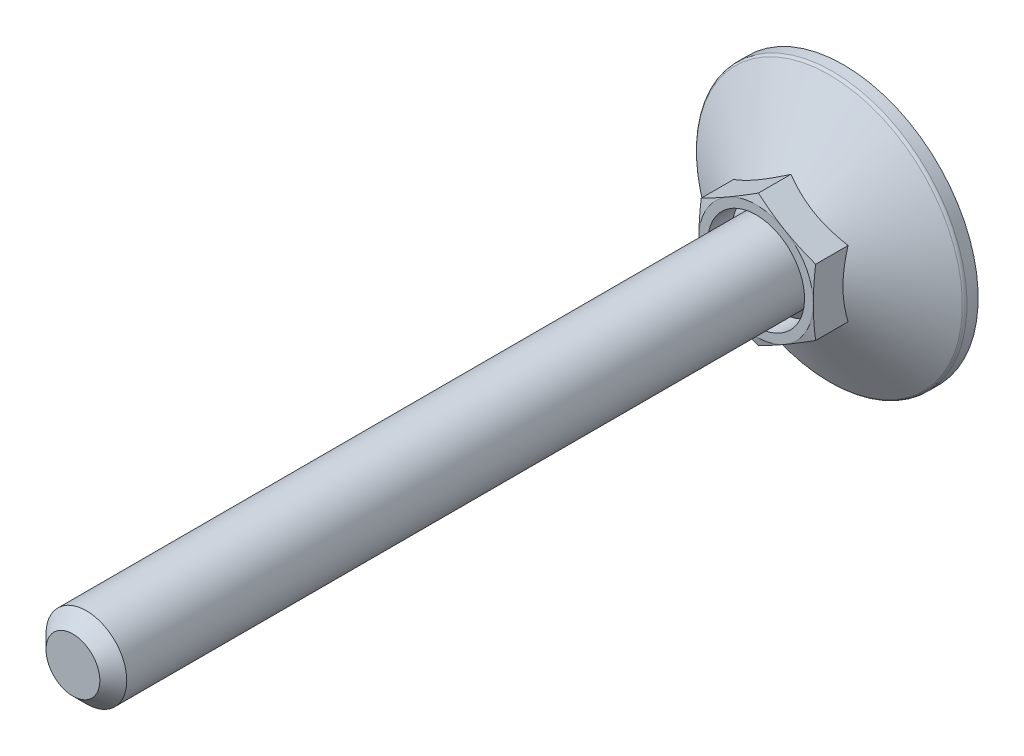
ISO-10303-21;
HEADER;
FILE_DESCRIPTION(('STEP AP214'),'2;1');
FILE_NAME('part.step','',(''),(''),'','','');
FILE_SCHEMA(('AUTOMOTIVE_DESIGN { 1 0 10303 214 1 1 1 1 }'));
ENDSEC;
DATA;
#1=APPLICATION_CONTEXT('core data for automotive mechanical design processes');
#2=APPLICATION_PROTOCOL_DEFINITION('international standard','automotive_design',2000,#1);
#3=PRODUCT_CONTEXT('',#1,'mechanical');
#4=PRODUCT('Part','Part','',(#3));
#5=PRODUCT_RELATED_PRODUCT_CATEGORY('part','',(#4));
#6=PRODUCT_DEFINITION_FORMATION('','',#4);
#7=PRODUCT_DEFINITION_CONTEXT('part definition',#1,'design');
#8=PRODUCT_DEFINITION('design','',#6,#7);
#9=PRODUCT_DEFINITION_SHAPE('','',#8);
#10=(LENGTH_UNIT() NAMED_UNIT(*) SI_UNIT(.MILLI.,.METRE.));
#11=(NAMED_UNIT(*) PLANE_ANGLE_UNIT() SI_UNIT($,.RADIAN.));
#12=(NAMED_UNIT(*) SI_UNIT($,.STERADIAN.) SOLID_ANGLE_UNIT());
#13=UNCERTAINTY_MEASURE_WITH_UNIT(LENGTH_MEASURE(1.E-05),#10,'distance_accuracy_value','');
#14=(GEOMETRIC_REPRESENTATION_CONTEXT(3) GLOBAL_UNCERTAINTY_ASSIGNED_CONTEXT((#13)) GLOBAL_UNIT_ASSIGNED_CONTEXT((#10,
#11,#12)) REPRESENTATION_CONTEXT('',''));
#15=CARTESIAN_POINT('',(0.,0.,0.));
#16=DIRECTION('',(0.,0.,1.));
#17=DIRECTION('',(1.,0.,0.));
#18=AXIS2_PLACEMENT_3D('',#15,#16,#17);
#19=CARTESIAN_POINT('',(0.,0.,0.));
#20=DIRECTION('',(0.,0.,-1.));
#21=DIRECTION('',(0.,1.,0.));
#22=AXIS2_PLACEMENT_3D('',#19,#20,#21);
#23=CYLINDRICAL_SURFACE('',#22,6.);
#24=CARTESIAN_POINT('',(0.,0.,112.5));
#25=DIRECTION('',(0.,0.,1.));
#26=DIRECTION('',(0.,-1.,0.));
#27=AXIS2_PLACEMENT_3D('',#24,#25,#26);
#28=CIRCLE('',#27,6.);
#29=CARTESIAN_POINT('',(0.,-6.,112.5));
#30=VERTEX_POINT('',#29);
#31=EDGE_CURVE('E9',#30,#30,#28,.F.);
#32=ORIENTED_EDGE('',*,*,#31,.T.);
#33=EDGE_LOOP('',(#32));
#34=FACE_BOUND('',#33,.T.);
#35=CARTESIAN_POINT('',(0.,0.,10.0329037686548));
#36=DIRECTION('',(0.,0.,-1.));
#37=DIRECTION('',(0.,1.,0.));
#38=AXIS2_PLACEMENT_3D('',#35,#36,#37);
#39=CIRCLE('',#38,6.);
#40=CARTESIAN_POINT('',(0.,6.,10.0329037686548));
#41=VERTEX_POINT('',#40);
#42=EDGE_CURVE('E180',#41,#41,#39,.F.);
#43=ORIENTED_EDGE('',*,*,#42,.T.);
#44=EDGE_LOOP('',(#43));
#45=FACE_BOUND('',#44,.T.);
#46=ADVANCED_FACE('F14',(#34,#45),#23,.T.);
#47=CARTESIAN_POINT('',(10.2,0.,0.));
#48=DIRECTION('',(0.,0.,1.));
#49=DIRECTION('',(0.,-1.,0.));
#50=AXIS2_PLACEMENT_3D('',#47,#48,#49);
#51=PLANE('',#50);
#52=DIRECTION('',(1.,0.,0.));
#53=VECTOR('',#52,1.);
#54=CARTESIAN_POINT('',(1.,-1.,0.));
#55=LINE('',#54,#53);
#56=CARTESIAN_POINT('',(1.,-1.,0.));
#57=VERTEX_POINT('',#56);
#58=CARTESIAN_POINT('',(6.66666666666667,-1.,0.));
#59=VERTEX_POINT('',#58);
#60=EDGE_CURVE('E706',#57,#59,#55,.T.);
#61=ORIENTED_EDGE('',*,*,#60,.T.);
#62=DIRECTION('',(0.,-1.,0.));
#63=VECTOR('',#62,1.);
#64=CARTESIAN_POINT('',(6.66666666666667,0.,0.));
#65=LINE('',#64,#63);
#66=CARTESIAN_POINT('',(6.66666666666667,1.,0.));
#67=VERTEX_POINT('',#66);
#68=EDGE_CURVE('E379',#67,#59,#65,.T.);
#69=ORIENTED_EDGE('',*,*,#68,.F.);
#70=DIRECTION('',(-1.,0.,0.));
#71=VECTOR('',#70,1.);
#72=CARTESIAN_POINT('',(6.66666666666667,1.,0.));
#73=LINE('',#72,#71);
#74=CARTESIAN_POINT('',(1.,1.,0.));
#75=VERTEX_POINT('',#74);
#76=EDGE_CURVE('E665',#67,#75,#73,.T.);
#77=ORIENTED_EDGE('',*,*,#76,.T.);
#78=DIRECTION('',(0.,1.,0.));
#79=VECTOR('',#78,1.);
#80=CARTESIAN_POINT('',(1.,1.,0.));
#81=LINE('',#80,#79);
#82=CARTESIAN_POINT('',(1.,6.66666666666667,0.));
#83=VERTEX_POINT('',#82);
#84=EDGE_CURVE('E662',#75,#83,#81,.T.);
#85=ORIENTED_EDGE('',*,*,#84,.T.);
#86=DIRECTION('',(-1.,0.,0.));
#87=VECTOR('',#86,1.);
#88=CARTESIAN_POINT('',(1.,6.66666666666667,0.));
#89=LINE('',#88,#87);
#90=CARTESIAN_POINT('',(-1.,6.66666666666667,0.));
#91=VERTEX_POINT('',#90);
#92=EDGE_CURVE('E655',#83,#91,#89,.T.);
#93=ORIENTED_EDGE('',*,*,#92,.T.);
#94=DIRECTION('',(0.,-1.,0.));
#95=VECTOR('',#94,1.);
#96=CARTESIAN_POINT('',(-1.,6.66666666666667,0.));
#97=LINE('',#96,#95);
#98=CARTESIAN_POINT('',(-1.,1.,0.));
#99=VERTEX_POINT('',#98);
#100=EDGE_CURVE('E175',#91,#99,#97,.T.);
#101=ORIENTED_EDGE('',*,*,#100,.T.);
#102=DIRECTION('',(-1.,0.,0.));
#103=VECTOR('',#102,1.);
#104=CARTESIAN_POINT('',(-1.,1.,0.));
#105=LINE('',#104,#103);
#106=CARTESIAN_POINT('',(-6.66666666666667,1.,0.));
#107=VERTEX_POINT('',#106);
#108=EDGE_CURVE('E29',#99,#107,#105,.T.);
#109=ORIENTED_EDGE('',*,*,#108,.T.);
#110=DIRECTION('',(0.,-1.,0.));
#111=VECTOR('',#110,1.);
#112=CARTESIAN_POINT('',(-6.66666666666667,1.,0.));
#113=LINE('',#112,#111);
#114=CARTESIAN_POINT('',(-6.66666666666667,-1.,0.));
#115=VERTEX_POINT('',#114);
#116=EDGE_CURVE('E179',#107,#115,#113,.T.);
#117=ORIENTED_EDGE('',*,*,#116,.T.);
#118=DIRECTION('',(1.,0.,0.));
#119=VECTOR('',#118,1.);
#120=CARTESIAN_POINT('',(-6.66666666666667,-1.,0.));
#121=LINE('',#120,#119);
#122=CARTESIAN_POINT('',(-1.,-1.,0.));
#123=VERTEX_POINT('',#122);
#124=EDGE_CURVE('E690',#115,#123,#121,.T.);
#125=ORIENTED_EDGE('',*,*,#124,.T.);
#126=DIRECTION('',(0.,-1.,0.));
#127=VECTOR('',#126,1.);
#128=CARTESIAN_POINT('',(-1.,-1.,0.));
#129=LINE('',#128,#127);
#130=CARTESIAN_POINT('',(-1.,-6.66666666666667,0.));
#131=VERTEX_POINT('',#130);
#132=EDGE_CURVE('E692',#123,#131,#129,.T.);
#133=ORIENTED_EDGE('',*,*,#132,.T.);
#134=DIRECTION('',(1.,0.,0.));
#135=VECTOR('',#134,1.);
#136=CARTESIAN_POINT('',(-1.,-6.66666666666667,0.));
#137=LINE('',#136,#135);
#138=CARTESIAN_POINT('',(1.,-6.66666666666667,0.));
#139=VERTEX_POINT('',#138);
#140=EDGE_CURVE('E696',#131,#139,#137,.T.);
#141=ORIENTED_EDGE('',*,*,#140,.T.);
#142=DIRECTION('',(0.,1.,0.));
#143=VECTOR('',#142,1.);
#144=CARTESIAN_POINT('',(1.,-6.66666666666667,0.));
#145=LINE('',#144,#143);
#146=EDGE_CURVE('E703',#139,#57,#145,.T.);
#147=ORIENTED_EDGE('',*,*,#146,.T.);
#148=EDGE_LOOP('',(#61,#69,#77,#85,#93,#101,#109,#117,#125,#133,#141,#147));
#149=FACE_BOUND('',#148,.T.);
#150=CARTESIAN_POINT('',(0.,0.,0.));
#151=DIRECTION('',(0.,0.,-1.));
#152=DIRECTION('',(0.,1.,0.));
#153=AXIS2_PLACEMENT_3D('',#150,#151,#152);
#154=CIRCLE('',#153,20.);
#155=CARTESIAN_POINT('',(0.,20.,0.));
#156=VERTEX_POINT('',#155);
#157=EDGE_CURVE('E184',#156,#156,#154,.T.);
#158=ORIENTED_EDGE('',*,*,#157,.T.);
#159=EDGE_LOOP('',(#158));
#160=FACE_BOUND('',#159,.T.);
#161=ADVANCED_FACE('F223',(#149,#160),#51,.F.);
#162=CARTESIAN_POINT('',(0.,0.,13.4970053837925));
#163=DIRECTION('',(0.,0.,-1.));
#164=DIRECTION('',(0.,1.,0.));
#165=AXIS2_PLACEMENT_3D('',#162,#163,#164);
#166=CONICAL_SURFACE('',#165,0.,1.0471975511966);
#167=CARTESIAN_POINT('',(0.,0.,9.34008344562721));
#168=DIRECTION('',(0.,0.,-1.));
#169=DIRECTION('',(0.,1.,0.));
#170=AXIS2_PLACEMENT_3D('',#167,#168,#169);
#171=CIRCLE('',#170,7.2);
#172=CARTESIAN_POINT('',(0.,7.2,9.34008344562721));
#173=VERTEX_POINT('',#172);
#174=EDGE_CURVE('E423',#173,#173,#171,.F.);
#175=ORIENTED_EDGE('',*,*,#174,.T.);
#176=EDGE_LOOP('',(#175));
#177=FACE_BOUND('',#176,.T.);
#178=ORIENTED_EDGE('',*,*,#42,.F.);
#179=EDGE_LOOP('',(#178));
#180=FACE_BOUND('',#179,.T.);
#181=ADVANCED_FACE('F217',(#177,#180),#166,.T.);
#182=CARTESIAN_POINT('',(0.,0.,0.));
#183=DIRECTION('',(0.,0.,-1.));
#184=DIRECTION('',(0.,1.,0.));
#185=AXIS2_PLACEMENT_3D('',#182,#183,#184);
#186=CYLINDRICAL_SURFACE('',#185,7.2);
#187=CARTESIAN_POINT('',(0.,0.,13.));
#188=DIRECTION('',(0.,0.,-1.));
#189=DIRECTION('',(0.,1.,0.));
#190=AXIS2_PLACEMENT_3D('',#187,#188,#189);
#191=CIRCLE('',#190,7.2);
#192=CARTESIAN_POINT('',(0.,7.2,13.));
#193=VERTEX_POINT('',#192);
#194=EDGE_CURVE('E380',#193,#193,#191,.T.);
#195=ORIENTED_EDGE('',*,*,#194,.F.);
#196=EDGE_LOOP('',(#195));
#197=FACE_BOUND('',#196,.T.);
#198=ORIENTED_EDGE('',*,*,#174,.F.);
#199=EDGE_LOOP('',(#198));
#200=FACE_BOUND('',#199,.T.);
#201=ADVANCED_FACE('F222',(#197,#200),#186,.F.);
#202=CARTESIAN_POINT('',(0.,9.81495457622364,199.));
#203=DIRECTION('',(0.5,-0.866025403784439,0.));
#204=DIRECTION('',(0.866025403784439,0.5,0.));
#205=AXIS2_PLACEMENT_3D('',#202,#203,#204);
#206=PLANE('',#205);
#207=CARTESIAN_POINT('',(-8.5002,4.90736181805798,7.83027204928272));
#208=CARTESIAN_POINT('',(-8.31336077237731,5.01523349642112,7.89254195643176));
#209=CARTESIAN_POINT('',(-8.1258249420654,5.1235073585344,7.95198579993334));
#210=CARTESIAN_POINT('',(-7.74923024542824,5.34093440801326,8.06444298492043));
#211=CARTESIAN_POINT('',(-7.56017075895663,5.45008795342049,8.1174535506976));
#212=CARTESIAN_POINT('',(-6.9899652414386,5.77929626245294,8.26579470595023));
#213=CARTESIAN_POINT('',(-6.60656835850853,6.00065055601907,8.3501691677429));
#214=CARTESIAN_POINT('',(-6.03282233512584,6.33190297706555,8.44910807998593));
#215=CARTESIAN_POINT('',(-5.84418723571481,6.44081150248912,8.47729289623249));
#216=CARTESIAN_POINT('',(-5.46606397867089,6.65912106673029,8.52455401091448));
#217=CARTESIAN_POINT('',(-5.27657589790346,6.76852206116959,8.54363111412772));
#218=CARTESIAN_POINT('',(-4.8972734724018,6.98751241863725,8.57219332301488));
#219=CARTESIAN_POINT('',(-4.7074597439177,7.09710142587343,8.58168931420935));
#220=CARTESIAN_POINT('',(-4.32765694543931,7.3163806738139,8.59088571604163));
#221=CARTESIAN_POINT('',(-4.13766788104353,7.42607091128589,8.59058642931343));
#222=CARTESIAN_POINT('',(-3.78247698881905,7.63114046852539,8.58087362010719));
#223=CARTESIAN_POINT('',(-3.6172500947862,7.72653426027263,8.57264492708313));
#224=CARTESIAN_POINT('',(-3.28718328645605,7.9170984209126,8.54893885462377));
#225=CARTESIAN_POINT('',(-3.12234339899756,8.01226877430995,8.53346098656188));
#226=CARTESIAN_POINT('',(-2.62846189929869,8.29741139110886,8.47651947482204));
#227=CARTESIAN_POINT('',(-2.30029449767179,8.48687892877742,8.42455503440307));
#228=CARTESIAN_POINT('',(-1.64047857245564,8.86782383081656,8.29464315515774));
#229=CARTESIAN_POINT('',(-1.30891425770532,9.05925257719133,8.21614502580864));
#230=CARTESIAN_POINT('',(-0.650730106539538,9.43925537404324,8.03798675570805));
#231=CARTESIAN_POINT('',(-0.324101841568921,9.62783429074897,7.93836845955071));
#232=CARTESIAN_POINT('',(0.000199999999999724,9.81507004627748,7.83027204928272));
#233=B_SPLINE_CURVE_WITH_KNOTS('',3,(#207,#208,#209,#210,#211,#212,#213,#214,#215,#216,#217,
#218,#219,#220,#221,#222,#223,#224,#225,#226,#227,#228,#229,#230,#231,#232),.UNSPECIFIED.,.F.,
.F.,(4,2,2,2,2,2,2,2,2,2,2,2,4),(0.,0.673596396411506,1.34748239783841,2.69805431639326,
3.356799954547,4.01548737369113,4.67342558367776,5.33134346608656,5.90409556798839,
6.47688628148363,7.62328361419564,8.79510569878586,9.9646274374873),.UNSPECIFIED.);
#234=CARTESIAN_POINT('',(-8.5,4.90747728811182,7.83033871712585));
#235=VERTEX_POINT('',#234);
#236=CARTESIAN_POINT('',(0.,9.81495457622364,7.83033871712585));
#237=VERTEX_POINT('',#236);
#238=EDGE_CURVE('E256',#235,#237,#233,.T.);
#239=ORIENTED_EDGE('',*,*,#238,.F.);
#240=DIRECTION('',(0.,0.,-1.));
#241=VECTOR('',#240,1.);
#242=CARTESIAN_POINT('',(-8.5,4.90747728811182,199.));
#243=LINE('',#242,#241);
#244=CARTESIAN_POINT('',(-8.5,4.90747728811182,12.6476589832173));
#245=VERTEX_POINT('',#244);
#246=EDGE_CURVE('E431',#245,#235,#243,.T.);
#247=ORIENTED_EDGE('',*,*,#246,.F.);
#248=CARTESIAN_POINT('',(0.000200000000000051,9.81507004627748,12.6476280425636));
#249=CARTESIAN_POINT('',(-0.352800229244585,9.61126526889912,12.7022599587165));
#250=CARTESIAN_POINT('',(-0.706440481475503,9.40709097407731,12.7518566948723));
#251=CARTESIAN_POINT('',(-1.41496987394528,8.99802133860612,12.8389934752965));
#252=CARTESIAN_POINT('',(-1.76985946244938,8.79312573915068,12.8765286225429));
#253=CARTESIAN_POINT('',(-2.47873586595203,8.38385575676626,12.9373509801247));
#254=CARTESIAN_POINT('',(-2.83271788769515,8.17948414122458,12.9607107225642));
#255=CARTESIAN_POINT('',(-3.5411333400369,7.77048028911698,12.9920337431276));
#256=CARTESIAN_POINT('',(-3.89556667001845,7.56584811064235,13.));
#257=CARTESIAN_POINT('',(-4.60443332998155,7.15658375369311,13.));
#258=CARTESIAN_POINT('',(-4.9588666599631,6.95195157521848,12.9920337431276));
#259=CARTESIAN_POINT('',(-5.66728211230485,6.54294772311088,12.9607107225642));
#260=CARTESIAN_POINT('',(-6.02126413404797,6.33857610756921,12.9373509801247));
#261=CARTESIAN_POINT('',(-6.73014053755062,5.92930612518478,12.8765286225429));
#262=CARTESIAN_POINT('',(-7.08503012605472,5.72441052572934,12.8389934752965));
#263=CARTESIAN_POINT('',(-7.7935595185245,5.31534089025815,12.7518566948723));
#264=CARTESIAN_POINT('',(-8.14719977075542,5.11116659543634,12.7022599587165));
#265=CARTESIAN_POINT('',(-8.5002,4.90736181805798,12.6476280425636));
#266=B_SPLINE_CURVE_WITH_KNOTS('',3,(#248,#249,#250,#251,#252,#253,#254,#255,#256,#257,#258,
#259,#260,#261,#262,#263,#264,#265),.UNSPECIFIED.,.F.,.F.,(4,2,2,2,2,2,2,2,4),(0.,
1.23382789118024,2.46815608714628,3.69611406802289,4.92383440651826,6.15155474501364,
7.37951272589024,8.61384092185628,9.84766881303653),.UNSPECIFIED.);
#267=CARTESIAN_POINT('',(-4.25,7.36121593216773,13.));
#268=VERTEX_POINT('',#267);
#269=EDGE_CURVE('E286',#268,#245,#266,.T.);
#270=ORIENTED_EDGE('',*,*,#269,.F.);
#271=CARTESIAN_POINT('',(0.,9.81495457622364,12.6476589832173));
#272=VERTEX_POINT('',#271);
#273=EDGE_CURVE('E395',#272,#268,#266,.T.);
#274=ORIENTED_EDGE('',*,*,#273,.F.);
#275=DIRECTION('',(0.,0.,-1.));
#276=VECTOR('',#275,1.);
#277=CARTESIAN_POINT('',(0.,9.81495457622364,199.));
#278=LINE('',#277,#276);
#279=EDGE_CURVE('E415',#272,#237,#278,.T.);
#280=ORIENTED_EDGE('',*,*,#279,.T.);
#281=EDGE_LOOP('',(#239,#247,#270,#274,#280));
#282=FACE_BOUND('',#281,.T.);
#283=ADVANCED_FACE('F228',(#282),#206,.F.);
#284=CARTESIAN_POINT('',(8.5,4.90747728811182,199.));
#285=DIRECTION('',(-0.5,-0.866025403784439,0.));
#286=DIRECTION('',(0.866025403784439,-0.5,0.));
#287=AXIS2_PLACEMENT_3D('',#284,#285,#286);
#288=PLANE('',#287);
#289=CARTESIAN_POINT('',(-0.0002,9.81507004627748,7.83027204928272));
#290=CARTESIAN_POINT('',(0.186639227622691,9.70719836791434,7.89254195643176));
#291=CARTESIAN_POINT('',(0.374175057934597,9.59892450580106,7.95198579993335));
#292=CARTESIAN_POINT('',(0.750769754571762,9.3814974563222,8.06444298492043));
#293=CARTESIAN_POINT('',(0.939829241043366,9.27234391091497,8.1174535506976));
#294=CARTESIAN_POINT('',(1.5100347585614,8.94313560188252,8.26579470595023));
#295=CARTESIAN_POINT('',(1.89343164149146,8.72178130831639,8.3501691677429));
#296=CARTESIAN_POINT('',(2.46717766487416,8.39052888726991,8.44910807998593));
#297=CARTESIAN_POINT('',(2.65581276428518,8.28162036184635,8.47729289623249));
#298=CARTESIAN_POINT('',(3.03393602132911,8.06331079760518,8.52455401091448));
#299=CARTESIAN_POINT('',(3.22342410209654,7.95390980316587,8.54363111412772));
#300=CARTESIAN_POINT('',(3.6027265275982,7.73491944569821,8.57219332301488));
#301=CARTESIAN_POINT('',(3.79254025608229,7.62533043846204,8.58168931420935));
#302=CARTESIAN_POINT('',(4.17234305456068,7.40605119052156,8.59088571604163));
#303=CARTESIAN_POINT('',(4.36233211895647,7.29636095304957,8.59058642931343));
#304=CARTESIAN_POINT('',(4.71752301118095,7.09129139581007,8.58087362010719));
#305=CARTESIAN_POINT('',(4.8827499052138,6.99589760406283,8.57264492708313));
#306=CARTESIAN_POINT('',(5.21281671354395,6.80533344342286,8.54893885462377));
#307=CARTESIAN_POINT('',(5.37765660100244,6.71016309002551,8.53346098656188));
#308=CARTESIAN_POINT('',(5.87153810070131,6.42502047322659,8.47651947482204));
#309=CARTESIAN_POINT('',(6.19970550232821,6.23555293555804,8.42455503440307));
#310=CARTESIAN_POINT('',(6.85952142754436,5.8546080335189,8.29464315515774));
#311=CARTESIAN_POINT('',(7.19108574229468,5.66317928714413,8.21614502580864));
#312=CARTESIAN_POINT('',(7.84926989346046,5.28317649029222,8.03798675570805));
#313=CARTESIAN_POINT('',(8.17589815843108,5.09459757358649,7.93836845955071));
#314=CARTESIAN_POINT('',(8.5002,4.90736181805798,7.83027204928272));
#315=B_SPLINE_CURVE_WITH_KNOTS('',3,(#289,#290,#291,#292,#293,#294,#295,#296,#297,#298,#299,
#300,#301,#302,#303,#304,#305,#306,#307,#308,#309,#310,#311,#312,#313,#314),.UNSPECIFIED.,.F.,
.F.,(4,2,2,2,2,2,2,2,2,2,2,2,4),(0.,0.673596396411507,1.34748239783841,2.69805431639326,
3.35679995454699,4.01548737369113,4.67342558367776,5.33134346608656,5.90409556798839,
6.47688628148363,7.62328361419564,8.79510569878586,9.9646274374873),.UNSPECIFIED.);
#316=CARTESIAN_POINT('',(8.5,4.90747728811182,7.83033871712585));
#317=VERTEX_POINT('',#316);
#318=EDGE_CURVE('E37',#237,#317,#315,.T.);
#319=ORIENTED_EDGE('',*,*,#318,.F.);
#320=ORIENTED_EDGE('',*,*,#279,.F.);
#321=CARTESIAN_POINT('',(8.5002,4.90736181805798,12.6476280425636));
#322=CARTESIAN_POINT('',(8.14719977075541,5.11116659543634,12.7022599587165));
#323=CARTESIAN_POINT('',(7.7935595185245,5.31534089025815,12.7518566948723));
#324=CARTESIAN_POINT('',(7.08503012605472,5.72441052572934,12.8389934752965));
#325=CARTESIAN_POINT('',(6.73014053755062,5.92930612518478,12.8765286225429));
#326=CARTESIAN_POINT('',(6.02126413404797,6.33857610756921,12.9373509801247));
#327=CARTESIAN_POINT('',(5.66728211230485,6.54294772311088,12.9607107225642));
#328=CARTESIAN_POINT('',(4.9588666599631,6.95195157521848,12.9920337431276));
#329=CARTESIAN_POINT('',(4.60443332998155,7.15658375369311,13.));
#330=CARTESIAN_POINT('',(3.89556667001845,7.56584811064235,13.));
#331=CARTESIAN_POINT('',(3.5411333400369,7.77048028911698,12.9920337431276));
#332=CARTESIAN_POINT('',(2.83271788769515,8.17948414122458,12.9607107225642));
#333=CARTESIAN_POINT('',(2.47873586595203,8.38385575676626,12.9373509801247));
#334=CARTESIAN_POINT('',(1.76985946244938,8.79312573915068,12.8765286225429));
#335=CARTESIAN_POINT('',(1.41496987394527,8.99802133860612,12.8389934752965));
#336=CARTESIAN_POINT('',(0.7064404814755,9.40709097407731,12.7518566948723));
#337=CARTESIAN_POINT('',(0.352800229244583,9.61126526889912,12.7022599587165));
#338=CARTESIAN_POINT('',(-0.000200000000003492,9.81507004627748,12.6476280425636));
#339=B_SPLINE_CURVE_WITH_KNOTS('',3,(#321,#322,#323,#324,#325,#326,#327,#328,#329,#330,#331,
#332,#333,#334,#335,#336,#337,#338),.UNSPECIFIED.,.F.,.F.,(4,2,2,2,2,2,2,2,4),(0.,
1.23382789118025,2.46815608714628,3.69611406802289,4.92383440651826,6.15155474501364,
7.37951272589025,8.61384092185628,9.84766881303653),.UNSPECIFIED.);
#340=CARTESIAN_POINT('',(4.25,7.36121593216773,13.));
#341=VERTEX_POINT('',#340);
#342=EDGE_CURVE('E269',#341,#272,#339,.T.);
#343=ORIENTED_EDGE('',*,*,#342,.F.);
#344=CARTESIAN_POINT('',(8.5,4.90747728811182,12.6476589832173));
#345=VERTEX_POINT('',#344);
#346=EDGE_CURVE('E278',#345,#341,#339,.T.);
#347=ORIENTED_EDGE('',*,*,#346,.F.);
#348=DIRECTION('',(0.,0.,-1.));
#349=VECTOR('',#348,1.);
#350=CARTESIAN_POINT('',(8.5,4.90747728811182,199.));
#351=LINE('',#350,#349);
#352=EDGE_CURVE('E417',#345,#317,#351,.T.);
#353=ORIENTED_EDGE('',*,*,#352,.T.);
#354=EDGE_LOOP('',(#319,#320,#343,#347,#353));
#355=FACE_BOUND('',#354,.T.);
#356=ADVANCED_FACE('F262',(#355),#288,.F.);
#357=CARTESIAN_POINT('',(8.5,-4.90747728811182,199.));
#358=DIRECTION('',(-1.,0.,0.));
#359=DIRECTION('',(0.,-1.,0.));
#360=AXIS2_PLACEMENT_3D('',#357,#358,#359);
#361=PLANE('',#360);
#362=CARTESIAN_POINT('',(8.5,12.8220542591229,4.61528116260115));
#363=CARTESIAN_POINT('',(8.5,12.4534155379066,4.79262377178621));
#364=CARTESIAN_POINT('',(8.5,12.0838902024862,4.96815716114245));
#365=CARTESIAN_POINT('',(8.5,11.3425927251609,5.31457894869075));
#366=CARTESIAN_POINT('',(8.5,10.9708202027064,5.48546653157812));
#367=CARTESIAN_POINT('',(8.5,10.2224625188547,5.82250763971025));
#368=CARTESIAN_POINT('',(8.5,9.84586188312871,5.98862693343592));
#369=CARTESIAN_POINT('',(8.5,9.08953299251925,6.31355867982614));
#370=CARTESIAN_POINT('',(8.5,8.70980489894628,6.47237150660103));
#371=CARTESIAN_POINT('',(8.5,7.93635853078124,6.78489169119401));
#372=CARTESIAN_POINT('',(8.5,7.5425381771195,6.93834789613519));
#373=CARTESIAN_POINT('',(8.5,6.75016193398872,7.23275009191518));
#374=CARTESIAN_POINT('',(8.5,6.35160550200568,7.37369463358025));
#375=CARTESIAN_POINT('',(8.5,5.54998630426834,7.63911020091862));
#376=CARTESIAN_POINT('',(8.5,5.14693580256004,7.76361784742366));
#377=CARTESIAN_POINT('',(8.5,4.33508769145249,7.99193558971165));
#378=CARTESIAN_POINT('',(8.5,3.92629204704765,8.09575258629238));
#379=CARTESIAN_POINT('',(8.5,3.10458766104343,8.27700176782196));
#380=CARTESIAN_POINT('',(8.5,2.69170444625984,8.35454642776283));
#381=CARTESIAN_POINT('',(8.5,2.06892742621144,8.44757828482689));
#382=CARTESIAN_POINT('',(8.5,1.86074253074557,8.47470931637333));
#383=CARTESIAN_POINT('',(8.5,1.44346514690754,8.52067173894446));
#384=CARTESIAN_POINT('',(8.5,1.23437274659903,8.5395039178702));
#385=CARTESIAN_POINT('',(8.5,0.818123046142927,8.5682751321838));
#386=CARTESIAN_POINT('',(8.5,0.6109730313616,8.57831925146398));
#387=CARTESIAN_POINT('',(8.5,0.196434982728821,8.58967320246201));
#388=CARTESIAN_POINT('',(8.5,-0.0109530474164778,8.59098316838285));
#389=CARTESIAN_POINT('',(8.5,-0.425608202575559,8.58483724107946));
#390=CARTESIAN_POINT('',(8.5,-0.632875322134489,8.57738097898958));
#391=CARTESIAN_POINT('',(8.5,-1.04692490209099,8.55387613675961));
#392=CARTESIAN_POINT('',(8.5,-1.25370733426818,8.5378270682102));
#393=CARTESIAN_POINT('',(8.5,-1.76172684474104,8.48816674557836));
#394=CARTESIAN_POINT('',(8.5,-2.06251418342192,8.44986872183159));
#395=CARTESIAN_POINT('',(8.5,-2.66160170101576,8.35726697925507));
#396=CARTESIAN_POINT('',(8.5,-2.95990148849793,8.30296078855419));
#397=CARTESIAN_POINT('',(8.5,-3.85084347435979,8.11893322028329));
#398=CARTESIAN_POINT('',(8.5,-4.4391769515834,7.96814146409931));
#399=CARTESIAN_POINT('',(8.5,-5.31919968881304,7.70971639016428));
#400=CARTESIAN_POINT('',(8.5,-5.61551051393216,7.61694416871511));
#401=CARTESIAN_POINT('',(8.5,-6.20524874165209,7.4225646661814));
#402=CARTESIAN_POINT('',(8.5,-6.4986761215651,7.3209573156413));
#403=CARTESIAN_POINT('',(8.5,-7.08276471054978,7.11046965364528));
#404=CARTESIAN_POINT('',(8.5,-7.37342689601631,7.0015920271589));
#405=CARTESIAN_POINT('',(8.5,-7.95239195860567,6.77777126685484));
#406=CARTESIAN_POINT('',(8.5,-8.2406948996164,6.66282829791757));
#407=CARTESIAN_POINT('',(8.5,-8.80562449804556,6.43181846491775));
#408=CARTESIAN_POINT('',(8.5,-9.08231928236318,6.31591764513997));
#409=CARTESIAN_POINT('',(8.5,-9.63401072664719,6.0801365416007));
#410=CARTESIAN_POINT('',(8.5,-9.90900735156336,5.96025617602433));
#411=CARTESIAN_POINT('',(8.5,-10.7318217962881,5.59557173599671));
#412=CARTESIAN_POINT('',(8.5,-11.2774137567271,5.34574521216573));
#413=CARTESIAN_POINT('',(8.5,-12.3642460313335,4.83628492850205));
#414=CARTESIAN_POINT('',(8.5,-12.905484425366,4.57664710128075));
#415=CARTESIAN_POINT('',(8.5,-13.9843891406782,4.05013469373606));
#416=CARTESIAN_POINT('',(8.5,-14.5220556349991,3.78326046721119));
#417=CARTESIAN_POINT('',(8.5,-15.5954930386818,3.24355438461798));
#418=CARTESIAN_POINT('',(8.5,-16.1312593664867,2.97071343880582));
#419=CARTESIAN_POINT('',(8.5,-17.2005865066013,2.4207361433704));
#420=CARTESIAN_POINT('',(8.5,-17.7341472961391,2.14359974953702));
#421=CARTESIAN_POINT('',(8.5,-18.7993643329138,1.58600707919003));
#422=CARTESIAN_POINT('',(8.5,-19.3310210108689,1.30555162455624));
#423=CARTESIAN_POINT('',(8.5,-20.3928917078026,0.741921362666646));
#424=CARTESIAN_POINT('',(8.5,-20.9231057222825,0.458746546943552));
#425=CARTESIAN_POINT('',(8.5,-22.3874236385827,-0.32722037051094));
#426=CARTESIAN_POINT('',(8.5,-23.3202800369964,-0.83233607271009));
#427=CARTESIAN_POINT('',(8.5,-25.1833983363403,-1.84747335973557));
#428=CARTESIAN_POINT('',(8.5,-26.1136600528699,-2.35749528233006));
#429=CARTESIAN_POINT('',(8.5,-27.9692131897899,-3.37950461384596));
#430=CARTESIAN_POINT('',(8.5,-28.8945109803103,-3.89148046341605));
#431=CARTESIAN_POINT('',(8.5,-30.2812847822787,-4.66146611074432));
#432=CARTESIAN_POINT('',(8.5,-30.7433285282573,-4.91845451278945));
#433=CARTESIAN_POINT('',(8.5,-31.6670795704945,-5.43303439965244));
#434=CARTESIAN_POINT('',(8.5,-32.1287868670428,-5.69062588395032));
#435=CARTESIAN_POINT('',(8.5,-32.5903473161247,-5.94848028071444));
#436=B_SPLINE_CURVE_WITH_KNOTS('',3,(#362,#363,#364,#365,#366,#367,#368,#369,#370,#371,#372,
#373,#374,#375,#376,#377,#378,#379,#380,#381,#382,#383,#384,#385,#386,#387,#388,#389,#390,#391,
#392,#393,#394,#395,#396,#397,#398,#399,#400,#401,#402,#403,#404,#405,#406,#407,#408,#409,#410,
#411,#412,#413,#414,#415,#416,#417,#418,#419,#420,#421,#422,#423,#424,#425,#426,#427,#428,#429,
#430,#431,#432,#433,#434,#435),.UNSPECIFIED.,.F.,.F.,(4,2,2,2,2,2,2,2,2,2,2,2,2,2,2,2,2,2,2,2,2,
2,2,2,2,2,2,2,2,2,2,2,2,2,2,2,4),(0.,1.22725127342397,2.45471654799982,3.68948778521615,
4.92419572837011,6.19201746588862,7.45998585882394,8.72507978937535,9.98975107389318,
11.2489376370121,11.878634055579,12.5082706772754,13.1302712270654,13.7522622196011,
14.3742793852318,14.9963319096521,15.9054589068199,16.814726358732,18.6343169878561,
19.5657329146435,20.4971561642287,21.4282373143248,22.3592931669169,23.259222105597,
24.1591695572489,25.9592281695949,27.7600413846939,29.5607667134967,31.3644583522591,
33.1681685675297,34.9714411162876,36.7747192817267,39.9571898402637,43.1398810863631,
46.3123590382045,47.8984694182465,49.4845784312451),.UNSPECIFIED.);
#437=CARTESIAN_POINT('',(8.5,-4.90747728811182,7.83033871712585));
#438=VERTEX_POINT('',#437);
#439=EDGE_CURVE('E245',#317,#438,#436,.T.);
#440=ORIENTED_EDGE('',*,*,#439,.F.);
#441=ORIENTED_EDGE('',*,*,#352,.F.);
#442=CARTESIAN_POINT('',(8.5,12.9820891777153,11.1197370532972));
#443=CARTESIAN_POINT('',(8.5,12.5964686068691,11.2061594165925));
#444=CARTESIAN_POINT('',(8.5,12.2106068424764,11.2915248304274));
#445=CARTESIAN_POINT('',(8.5,11.4382824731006,11.4595712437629));
#446=CARTESIAN_POINT('',(8.5,11.0518198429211,11.5422521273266));
#447=CARTESIAN_POINT('',(8.5,10.2778290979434,11.7044309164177));
#448=CARTESIAN_POINT('',(8.5,9.89030030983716,11.7839256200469));
#449=CARTESIAN_POINT('',(8.5,9.11443612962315,11.9388739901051));
#450=CARTESIAN_POINT('',(8.5,8.72610074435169,12.0143276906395));
#451=CARTESIAN_POINT('',(8.5,7.95158013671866,12.159650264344));
#452=CARTESIAN_POINT('',(8.5,7.56540239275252,12.2295587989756));
#453=CARTESIAN_POINT('',(8.5,6.79199352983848,12.3632725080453));
#454=CARTESIAN_POINT('',(8.5,6.40476243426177,12.4270778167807));
#455=CARTESIAN_POINT('',(8.5,5.62917169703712,12.54714843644));
#456=CARTESIAN_POINT('',(8.5,5.24081220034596,12.6034146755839));
#457=CARTESIAN_POINT('',(8.5,4.46285737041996,12.70674908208));
#458=CARTESIAN_POINT('',(8.5,4.07326203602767,12.7538172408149));
#459=CARTESIAN_POINT('',(8.5,3.28844017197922,12.8374226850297));
#460=CARTESIAN_POINT('',(8.5,2.89320002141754,12.8738340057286));
#461=CARTESIAN_POINT('',(8.5,2.10172608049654,12.9336139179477));
#462=CARTESIAN_POINT('',(8.5,1.70549231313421,12.9569828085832));
#463=CARTESIAN_POINT('',(8.5,0.912605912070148,12.9893148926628));
#464=CARTESIAN_POINT('',(8.5,0.515953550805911,12.9982846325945));
#465=CARTESIAN_POINT('',(8.5,-0.27740821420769,13.0012669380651));
#466=CARTESIAN_POINT('',(8.5,-0.674117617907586,12.9952795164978));
#467=CARTESIAN_POINT('',(8.5,-1.46847963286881,12.9686842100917));
#468=CARTESIAN_POINT('',(8.5,-1.86613043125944,12.9480232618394));
#469=CARTESIAN_POINT('',(8.5,-2.66049684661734,12.8932602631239));
#470=CARTESIAN_POINT('',(8.5,-3.05721244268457,12.8591579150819));
#471=CARTESIAN_POINT('',(8.5,-3.84970511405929,12.7792347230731));
#472=CARTESIAN_POINT('',(8.5,-4.24548140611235,12.7334062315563));
#473=CARTESIAN_POINT('',(8.5,-5.03576028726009,12.6319377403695));
#474=CARTESIAN_POINT('',(8.5,-5.43026287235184,12.5762977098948));
#475=CARTESIAN_POINT('',(8.5,-6.19195385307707,12.4609360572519));
#476=CARTESIAN_POINT('',(8.5,-6.55922094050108,12.4017287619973));
#477=CARTESIAN_POINT('',(8.5,-7.29278719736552,12.2775674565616));
#478=CARTESIAN_POINT('',(8.5,-7.65908634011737,12.2126132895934));
#479=CARTESIAN_POINT('',(8.5,-8.39085027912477,12.078008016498));
#480=CARTESIAN_POINT('',(8.5,-8.75631499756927,12.0083564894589));
#481=CARTESIAN_POINT('',(8.5,-9.48649515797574,11.8652200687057));
#482=CARTESIAN_POINT('',(8.5,-9.85121059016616,11.7917351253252));
#483=CARTESIAN_POINT('',(8.5,-10.5800753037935,11.6416087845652));
#484=CARTESIAN_POINT('',(8.5,-10.944224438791,11.5649666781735));
#485=CARTESIAN_POINT('',(8.5,-11.6719684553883,11.4090909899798));
#486=CARTESIAN_POINT('',(8.5,-12.0355633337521,11.3298573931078));
#487=CARTESIAN_POINT('',(8.5,-13.1255915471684,11.0889686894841));
#488=CARTESIAN_POINT('',(8.5,-13.8513178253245,10.9241153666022));
#489=CARTESIAN_POINT('',(8.5,-15.2942598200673,10.590109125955));
#490=CARTESIAN_POINT('',(8.5,-16.0114890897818,10.421014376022));
#491=CARTESIAN_POINT('',(8.5,-17.4449475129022,10.0785875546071));
#492=CARTESIAN_POINT('',(8.5,-18.1611766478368,9.9052554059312));
#493=CARTESIAN_POINT('',(8.5,-19.5919856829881,9.55567998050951));
#494=CARTESIAN_POINT('',(8.5,-20.306566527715,9.37944056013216));
#495=CARTESIAN_POINT('',(8.5,-21.7351057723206,9.02455520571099));
#496=CARTESIAN_POINT('',(8.5,-22.4490641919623,8.84590935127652));
#497=CARTESIAN_POINT('',(8.5,-23.1628057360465,8.66641079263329));
#498=B_SPLINE_CURVE_WITH_KNOTS('',3,(#442,#443,#444,#445,#446,#447,#448,#449,#450,#451,#452,
#453,#454,#455,#456,#457,#458,#459,#460,#461,#462,#463,#464,#465,#466,#467,#468,#469,#470,#471,
#472,#473,#474,#475,#476,#477,#478,#479,#480,#481,#482,#483,#484,#485,#486,#487,#488,#489,#490,
#491,#492,#493,#494,#495,#496,#497),.UNSPECIFIED.,.F.,.F.,(4,2,2,2,2,2,2,2,2,2,2,2,2,2,2,2,2,2,
2,2,2,2,2,2,2,2,2,4),(0.,1.18556310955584,2.37117735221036,3.5579546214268,4.74472187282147,
5.92204594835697,7.09934411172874,8.27649719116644,9.45365137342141,10.6442044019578,
11.8347301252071,13.0247144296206,14.2146977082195,15.4090063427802,16.6033414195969,
17.7984574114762,18.9935771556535,20.1095500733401,21.2255534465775,22.3416569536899,
23.4577749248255,24.5741449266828,25.6905214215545,27.9231231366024,30.1337863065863,
32.3444897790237,34.5524651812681,36.7603677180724),.UNSPECIFIED.);
#499=CARTESIAN_POINT('',(8.5,0.,13.));
#500=VERTEX_POINT('',#499);
#501=EDGE_CURVE('E280',#500,#345,#498,.F.);
#502=ORIENTED_EDGE('',*,*,#501,.F.);
#503=CARTESIAN_POINT('',(8.5,-4.90747728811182,12.6476589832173));
#504=VERTEX_POINT('',#503);
#505=EDGE_CURVE('E279',#504,#500,#498,.F.);
#506=ORIENTED_EDGE('',*,*,#505,.F.);
#507=DIRECTION('',(0.,0.,-1.));
#508=VECTOR('',#507,1.);
#509=CARTESIAN_POINT('',(8.5,-4.90747728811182,199.));
#510=LINE('',#509,#508);
#511=EDGE_CURVE('E421',#504,#438,#510,.T.);
#512=ORIENTED_EDGE('',*,*,#511,.T.);
#513=EDGE_LOOP('',(#440,#441,#502,#506,#512));
#514=FACE_BOUND('',#513,.T.);
#515=ADVANCED_FACE('F265',(#514),#361,.F.);
#516=CARTESIAN_POINT('',(0.,-9.81495457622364,199.));
#517=DIRECTION('',(-0.5,0.866025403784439,0.));
#518=DIRECTION('',(-0.866025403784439,-0.5,0.));
#519=AXIS2_PLACEMENT_3D('',#516,#517,#518);
#520=PLANE('',#519);
#521=CARTESIAN_POINT('',(8.5002,-4.90736181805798,7.83027204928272));
#522=CARTESIAN_POINT('',(8.31336077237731,-5.01523349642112,7.89254195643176));
#523=CARTESIAN_POINT('',(8.1258249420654,-5.1235073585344,7.95198579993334));
#524=CARTESIAN_POINT('',(7.74923024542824,-5.34093440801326,8.06444298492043));
#525=CARTESIAN_POINT('',(7.56017075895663,-5.45008795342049,8.1174535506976));
#526=CARTESIAN_POINT('',(6.9899652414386,-5.77929626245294,8.26579470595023));
#527=CARTESIAN_POINT('',(6.60656835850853,-6.00065055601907,8.3501691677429));
#528=CARTESIAN_POINT('',(6.03282233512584,-6.33190297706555,8.44910807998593));
#529=CARTESIAN_POINT('',(5.84418723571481,-6.44081150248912,8.47729289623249));
#530=CARTESIAN_POINT('',(5.46606397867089,-6.65912106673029,8.52455401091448));
#531=CARTESIAN_POINT('',(5.27657589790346,-6.76852206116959,8.54363111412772));
#532=CARTESIAN_POINT('',(4.8972734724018,-6.98751241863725,8.57219332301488));
#533=CARTESIAN_POINT('',(4.7074597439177,-7.09710142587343,8.58168931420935));
#534=CARTESIAN_POINT('',(4.32765694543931,-7.3163806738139,8.59088571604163));
#535=CARTESIAN_POINT('',(4.13766788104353,-7.42607091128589,8.59058642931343));
#536=CARTESIAN_POINT('',(3.78247698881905,-7.63114046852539,8.58087362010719));
#537=CARTESIAN_POINT('',(3.6172500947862,-7.72653426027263,8.57264492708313));
#538=CARTESIAN_POINT('',(3.28718328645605,-7.9170984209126,8.54893885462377));
#539=CARTESIAN_POINT('',(3.12234339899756,-8.01226877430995,8.53346098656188));
#540=CARTESIAN_POINT('',(2.62846189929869,-8.29741139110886,8.47651947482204));
#541=CARTESIAN_POINT('',(2.30029449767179,-8.48687892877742,8.42455503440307));
#542=CARTESIAN_POINT('',(1.64047857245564,-8.86782383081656,8.29464315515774));
#543=CARTESIAN_POINT('',(1.30891425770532,-9.05925257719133,8.21614502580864));
#544=CARTESIAN_POINT('',(0.650730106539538,-9.43925537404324,8.03798675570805));
#545=CARTESIAN_POINT('',(0.324101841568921,-9.62783429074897,7.93836845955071));
#546=CARTESIAN_POINT('',(-0.000199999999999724,-9.81507004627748,7.83027204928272));
#547=B_SPLINE_CURVE_WITH_KNOTS('',3,(#521,#522,#523,#524,#525,#526,#527,#528,#529,#530,#531,
#532,#533,#534,#535,#536,#537,#538,#539,#540,#541,#542,#543,#544,#545,#546),.UNSPECIFIED.,.F.,
.F.,(4,2,2,2,2,2,2,2,2,2,2,2,4),(0.,0.673596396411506,1.34748239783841,2.69805431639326,
3.356799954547,4.01548737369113,4.67342558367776,5.33134346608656,5.90409556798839,
6.47688628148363,7.62328361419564,8.79510569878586,9.9646274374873),.UNSPECIFIED.);
#548=CARTESIAN_POINT('',(0.,-9.81495457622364,7.83033871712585));
#549=VERTEX_POINT('',#548);
#550=EDGE_CURVE('E207',#438,#549,#547,.T.);
#551=ORIENTED_EDGE('',*,*,#550,.F.);
#552=ORIENTED_EDGE('',*,*,#511,.F.);
#553=CARTESIAN_POINT('',(-0.000200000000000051,-9.81507004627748,12.6476280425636));
#554=CARTESIAN_POINT('',(0.352800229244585,-9.61126526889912,12.7022599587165));
#555=CARTESIAN_POINT('',(0.706440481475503,-9.40709097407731,12.7518566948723));
#556=CARTESIAN_POINT('',(1.41496987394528,-8.99802133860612,12.8389934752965));
#557=CARTESIAN_POINT('',(1.76985946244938,-8.79312573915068,12.8765286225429));
#558=CARTESIAN_POINT('',(2.47873586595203,-8.38385575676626,12.9373509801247));
#559=CARTESIAN_POINT('',(2.83271788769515,-8.17948414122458,12.9607107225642));
#560=CARTESIAN_POINT('',(3.5411333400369,-7.77048028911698,12.9920337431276));
#561=CARTESIAN_POINT('',(3.89556667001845,-7.56584811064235,13.));
#562=CARTESIAN_POINT('',(4.60443332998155,-7.15658375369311,13.));
#563=CARTESIAN_POINT('',(4.9588666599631,-6.95195157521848,12.9920337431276));
#564=CARTESIAN_POINT('',(5.66728211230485,-6.54294772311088,12.9607107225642));
#565=CARTESIAN_POINT('',(6.02126413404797,-6.33857610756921,12.9373509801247));
#566=CARTESIAN_POINT('',(6.73014053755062,-5.92930612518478,12.8765286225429));
#567=CARTESIAN_POINT('',(7.08503012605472,-5.72441052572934,12.8389934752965));
#568=CARTESIAN_POINT('',(7.7935595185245,-5.31534089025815,12.7518566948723));
#569=CARTESIAN_POINT('',(8.14719977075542,-5.11116659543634,12.7022599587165));
#570=CARTESIAN_POINT('',(8.5002,-4.90736181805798,12.6476280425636));
#571=B_SPLINE_CURVE_WITH_KNOTS('',3,(#553,#554,#555,#556,#557,#558,#559,#560,#561,#562,#563,
#564,#565,#566,#567,#568,#569,#570),.UNSPECIFIED.,.F.,.F.,(4,2,2,2,2,2,2,2,4),(0.,
1.23382789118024,2.46815608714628,3.69611406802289,4.92383440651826,6.15155474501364,
7.37951272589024,8.61384092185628,9.84766881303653),.UNSPECIFIED.);
#572=CARTESIAN_POINT('',(4.25,-7.36121593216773,13.));
#573=VERTEX_POINT('',#572);
#574=EDGE_CURVE('E320',#573,#504,#571,.T.);
#575=ORIENTED_EDGE('',*,*,#574,.F.);
#576=CARTESIAN_POINT('',(0.,-9.81495457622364,12.6476589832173));
#577=VERTEX_POINT('',#576);
#578=EDGE_CURVE('E326',#577,#573,#571,.T.);
#579=ORIENTED_EDGE('',*,*,#578,.F.);
#580=DIRECTION('',(0.,0.,-1.));
#581=VECTOR('',#580,1.);
#582=CARTESIAN_POINT('',(0.,-9.81495457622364,199.));
#583=LINE('',#582,#581);
#584=EDGE_CURVE('E427',#577,#549,#583,.T.);
#585=ORIENTED_EDGE('',*,*,#584,.T.);
#586=EDGE_LOOP('',(#551,#552,#575,#579,#585));
#587=FACE_BOUND('',#586,.T.);
#588=ADVANCED_FACE('F328',(#587),#520,.F.);
#589=CARTESIAN_POINT('',(-8.5,-4.90747728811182,199.));
#590=DIRECTION('',(0.5,0.866025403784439,0.));
#591=DIRECTION('',(-0.866025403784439,0.5,0.));
#592=AXIS2_PLACEMENT_3D('',#589,#590,#591);
#593=PLANE('',#592);
#594=CARTESIAN_POINT('',(0.0002,-9.81507004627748,7.83027204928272));
#595=CARTESIAN_POINT('',(-0.186639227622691,-9.70719836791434,7.89254195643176));
#596=CARTESIAN_POINT('',(-0.374175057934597,-9.59892450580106,7.95198579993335));
#597=CARTESIAN_POINT('',(-0.750769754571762,-9.3814974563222,8.06444298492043));
#598=CARTESIAN_POINT('',(-0.939829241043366,-9.27234391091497,8.1174535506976));
#599=CARTESIAN_POINT('',(-1.5100347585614,-8.94313560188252,8.26579470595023));
#600=CARTESIAN_POINT('',(-1.89343164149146,-8.72178130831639,8.3501691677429));
#601=CARTESIAN_POINT('',(-2.46717766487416,-8.39052888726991,8.44910807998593));
#602=CARTESIAN_POINT('',(-2.65581276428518,-8.28162036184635,8.47729289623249));
#603=CARTESIAN_POINT('',(-3.03393602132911,-8.06331079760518,8.52455401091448));
#604=CARTESIAN_POINT('',(-3.22342410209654,-7.95390980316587,8.54363111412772));
#605=CARTESIAN_POINT('',(-3.6027265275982,-7.73491944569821,8.57219332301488));
#606=CARTESIAN_POINT('',(-3.79254025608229,-7.62533043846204,8.58168931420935));
#607=CARTESIAN_POINT('',(-4.17234305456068,-7.40605119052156,8.59088571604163));
#608=CARTESIAN_POINT('',(-4.36233211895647,-7.29636095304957,8.59058642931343));
#609=CARTESIAN_POINT('',(-4.71752301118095,-7.09129139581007,8.58087362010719));
#610=CARTESIAN_POINT('',(-4.8827499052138,-6.99589760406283,8.57264492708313));
#611=CARTESIAN_POINT('',(-5.21281671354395,-6.80533344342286,8.54893885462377));
#612=CARTESIAN_POINT('',(-5.37765660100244,-6.71016309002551,8.53346098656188));
#613=CARTESIAN_POINT('',(-5.87153810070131,-6.42502047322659,8.47651947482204));
#614=CARTESIAN_POINT('',(-6.19970550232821,-6.23555293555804,8.42455503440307));
#615=CARTESIAN_POINT('',(-6.85952142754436,-5.8546080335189,8.29464315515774));
#616=CARTESIAN_POINT('',(-7.19108574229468,-5.66317928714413,8.21614502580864));
#617=CARTESIAN_POINT('',(-7.84926989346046,-5.28317649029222,8.03798675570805));
#618=CARTESIAN_POINT('',(-8.17589815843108,-5.09459757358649,7.93836845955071));
#619=CARTESIAN_POINT('',(-8.5002,-4.90736181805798,7.83027204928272));
#620=B_SPLINE_CURVE_WITH_KNOTS('',3,(#594,#595,#596,#597,#598,#599,#600,#601,#602,#603,#604,
#605,#606,#607,#608,#609,#610,#611,#612,#613,#614,#615,#616,#617,#618,#619),.UNSPECIFIED.,.F.,
.F.,(4,2,2,2,2,2,2,2,2,2,2,2,4),(0.,0.673596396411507,1.34748239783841,2.69805431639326,
3.35679995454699,4.01548737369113,4.67342558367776,5.33134346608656,5.90409556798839,
6.47688628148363,7.62328361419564,8.79510569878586,9.9646274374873),.UNSPECIFIED.);
#621=CARTESIAN_POINT('',(-8.5,-4.90747728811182,7.83033871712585));
#622=VERTEX_POINT('',#621);
#623=EDGE_CURVE('E198',#549,#622,#620,.T.);
#624=ORIENTED_EDGE('',*,*,#623,.F.);
#625=ORIENTED_EDGE('',*,*,#584,.F.);
#626=CARTESIAN_POINT('',(-8.5002,-4.90736181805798,12.6476280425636));
#627=CARTESIAN_POINT('',(-8.14719977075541,-5.11116659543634,12.7022599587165));
#628=CARTESIAN_POINT('',(-7.7935595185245,-5.31534089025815,12.7518566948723));
#629=CARTESIAN_POINT('',(-7.08503012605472,-5.72441052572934,12.8389934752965));
#630=CARTESIAN_POINT('',(-6.73014053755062,-5.92930612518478,12.8765286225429));
#631=CARTESIAN_POINT('',(-6.02126413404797,-6.33857610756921,12.9373509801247));
#632=CARTESIAN_POINT('',(-5.66728211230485,-6.54294772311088,12.9607107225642));
#633=CARTESIAN_POINT('',(-4.9588666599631,-6.95195157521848,12.9920337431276));
#634=CARTESIAN_POINT('',(-4.60443332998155,-7.15658375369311,13.));
#635=CARTESIAN_POINT('',(-3.89556667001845,-7.56584811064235,13.));
#636=CARTESIAN_POINT('',(-3.5411333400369,-7.77048028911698,12.9920337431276));
#637=CARTESIAN_POINT('',(-2.83271788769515,-8.17948414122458,12.9607107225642));
#638=CARTESIAN_POINT('',(-2.47873586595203,-8.38385575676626,12.9373509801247));
#639=CARTESIAN_POINT('',(-1.76985946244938,-8.79312573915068,12.8765286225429));
#640=CARTESIAN_POINT('',(-1.41496987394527,-8.99802133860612,12.8389934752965));
#641=CARTESIAN_POINT('',(-0.7064404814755,-9.40709097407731,12.7518566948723));
#642=CARTESIAN_POINT('',(-0.352800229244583,-9.61126526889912,12.7022599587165));
#643=CARTESIAN_POINT('',(0.000200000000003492,-9.81507004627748,12.6476280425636));
#644=B_SPLINE_CURVE_WITH_KNOTS('',3,(#626,#627,#628,#629,#630,#631,#632,#633,#634,#635,#636,
#637,#638,#639,#640,#641,#642,#643),.UNSPECIFIED.,.F.,.F.,(4,2,2,2,2,2,2,2,4),(0.,
1.23382789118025,2.46815608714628,3.69611406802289,4.92383440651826,6.15155474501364,
7.37951272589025,8.61384092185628,9.84766881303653),.UNSPECIFIED.);
#645=CARTESIAN_POINT('',(-4.25,-7.36121593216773,13.));
#646=VERTEX_POINT('',#645);
#647=EDGE_CURVE('E314',#646,#577,#644,.T.);
#648=ORIENTED_EDGE('',*,*,#647,.F.);
#649=CARTESIAN_POINT('',(-8.5,-4.90747728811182,12.6476589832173));
#650=VERTEX_POINT('',#649);
#651=EDGE_CURVE('E327',#650,#646,#644,.T.);
#652=ORIENTED_EDGE('',*,*,#651,.F.);
#653=DIRECTION('',(0.,0.,-1.));
#654=VECTOR('',#653,1.);
#655=CARTESIAN_POINT('',(-8.5,-4.90747728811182,199.));
#656=LINE('',#655,#654);
#657=EDGE_CURVE('E430',#650,#622,#656,.T.);
#658=ORIENTED_EDGE('',*,*,#657,.T.);
#659=EDGE_LOOP('',(#624,#625,#648,#652,#658));
#660=FACE_BOUND('',#659,.T.);
#661=ADVANCED_FACE('F214',(#660),#593,.F.);
#662=CARTESIAN_POINT('',(-8.5,4.90747728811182,199.));
#663=DIRECTION('',(1.,0.,0.));
#664=DIRECTION('',(0.,1.,0.));
#665=AXIS2_PLACEMENT_3D('',#662,#663,#664);
#666=PLANE('',#665);
#667=CARTESIAN_POINT('',(-8.5,12.8220542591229,4.61528116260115));
#668=CARTESIAN_POINT('',(-8.5,12.4534155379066,4.79262377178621));
#669=CARTESIAN_POINT('',(-8.5,12.0838902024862,4.96815716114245));
#670=CARTESIAN_POINT('',(-8.5,11.3425927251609,5.31457894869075));
#671=CARTESIAN_POINT('',(-8.5,10.9708202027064,5.48546653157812));
#672=CARTESIAN_POINT('',(-8.5,10.2224625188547,5.82250763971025));
#673=CARTESIAN_POINT('',(-8.5,9.84586188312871,5.98862693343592));
#674=CARTESIAN_POINT('',(-8.5,9.08953299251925,6.31355867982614));
#675=CARTESIAN_POINT('',(-8.5,8.70980489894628,6.47237150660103));
#676=CARTESIAN_POINT('',(-8.5,7.93635853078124,6.78489169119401));
#677=CARTESIAN_POINT('',(-8.5,7.5425381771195,6.93834789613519));
#678=CARTESIAN_POINT('',(-8.5,6.75016193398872,7.23275009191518));
#679=CARTESIAN_POINT('',(-8.5,6.35160550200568,7.37369463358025));
#680=CARTESIAN_POINT('',(-8.5,5.54998630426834,7.63911020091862));
#681=CARTESIAN_POINT('',(-8.5,5.14693580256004,7.76361784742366));
#682=CARTESIAN_POINT('',(-8.5,4.33508769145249,7.99193558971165));
#683=CARTESIAN_POINT('',(-8.5,3.92629204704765,8.09575258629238));
#684=CARTESIAN_POINT('',(-8.5,3.10458766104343,8.27700176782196));
#685=CARTESIAN_POINT('',(-8.5,2.69170444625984,8.35454642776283));
#686=CARTESIAN_POINT('',(-8.5,2.06892742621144,8.44757828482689));
#687=CARTESIAN_POINT('',(-8.5,1.86074253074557,8.47470931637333));
#688=CARTESIAN_POINT('',(-8.5,1.44346514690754,8.52067173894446));
#689=CARTESIAN_POINT('',(-8.5,1.23437274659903,8.5395039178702));
#690=CARTESIAN_POINT('',(-8.5,0.818123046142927,8.5682751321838));
#691=CARTESIAN_POINT('',(-8.5,0.6109730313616,8.57831925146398));
#692=CARTESIAN_POINT('',(-8.5,0.196434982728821,8.58967320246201));
#693=CARTESIAN_POINT('',(-8.5,-0.0109530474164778,8.59098316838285));
#694=CARTESIAN_POINT('',(-8.5,-0.425608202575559,8.58483724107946));
#695=CARTESIAN_POINT('',(-8.5,-0.632875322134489,8.57738097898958));
#696=CARTESIAN_POINT('',(-8.5,-1.04692490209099,8.55387613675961));
#697=CARTESIAN_POINT('',(-8.5,-1.25370733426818,8.5378270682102));
#698=CARTESIAN_POINT('',(-8.5,-1.76172684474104,8.48816674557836));
#699=CARTESIAN_POINT('',(-8.5,-2.06251418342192,8.44986872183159));
#700=CARTESIAN_POINT('',(-8.5,-2.66160170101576,8.35726697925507));
#701=CARTESIAN_POINT('',(-8.5,-2.95990148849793,8.30296078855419));
#702=CARTESIAN_POINT('',(-8.5,-3.85084347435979,8.11893322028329));
#703=CARTESIAN_POINT('',(-8.5,-4.4391769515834,7.96814146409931));
#704=CARTESIAN_POINT('',(-8.5,-5.31919968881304,7.70971639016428));
#705=CARTESIAN_POINT('',(-8.5,-5.61551051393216,7.61694416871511));
#706=CARTESIAN_POINT('',(-8.5,-6.20524874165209,7.4225646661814));
#707=CARTESIAN_POINT('',(-8.5,-6.4986761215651,7.3209573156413));
#708=CARTESIAN_POINT('',(-8.5,-7.08276471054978,7.11046965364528));
#709=CARTESIAN_POINT('',(-8.5,-7.37342689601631,7.0015920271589));
#710=CARTESIAN_POINT('',(-8.5,-7.95239195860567,6.77777126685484));
#711=CARTESIAN_POINT('',(-8.5,-8.2406948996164,6.66282829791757));
#712=CARTESIAN_POINT('',(-8.5,-8.80562449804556,6.43181846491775));
#713=CARTESIAN_POINT('',(-8.5,-9.08231928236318,6.31591764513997));
#714=CARTESIAN_POINT('',(-8.5,-9.63401072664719,6.0801365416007));
#715=CARTESIAN_POINT('',(-8.5,-9.90900735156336,5.96025617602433));
#716=CARTESIAN_POINT('',(-8.5,-10.7318217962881,5.59557173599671));
#717=CARTESIAN_POINT('',(-8.5,-11.2774137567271,5.34574521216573));
#718=CARTESIAN_POINT('',(-8.5,-12.3642460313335,4.83628492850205));
#719=CARTESIAN_POINT('',(-8.5,-12.905484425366,4.57664710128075));
#720=CARTESIAN_POINT('',(-8.5,-13.9843891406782,4.05013469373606));
#721=CARTESIAN_POINT('',(-8.5,-14.5220556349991,3.78326046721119));
#722=CARTESIAN_POINT('',(-8.5,-15.5954930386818,3.24355438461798));
#723=CARTESIAN_POINT('',(-8.5,-16.1312593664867,2.97071343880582));
#724=CARTESIAN_POINT('',(-8.5,-17.2005865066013,2.4207361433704));
#725=CARTESIAN_POINT('',(-8.5,-17.7341472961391,2.14359974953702));
#726=CARTESIAN_POINT('',(-8.5,-18.7993643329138,1.58600707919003));
#727=CARTESIAN_POINT('',(-8.5,-19.3310210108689,1.30555162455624));
#728=CARTESIAN_POINT('',(-8.5,-20.3928917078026,0.741921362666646));
#729=CARTESIAN_POINT('',(-8.5,-20.9231057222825,0.458746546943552));
#730=CARTESIAN_POINT('',(-8.5,-22.3874236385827,-0.32722037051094));
#731=CARTESIAN_POINT('',(-8.5,-23.3202800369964,-0.83233607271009));
#732=CARTESIAN_POINT('',(-8.5,-25.1833983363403,-1.84747335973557));
#733=CARTESIAN_POINT('',(-8.5,-26.1136600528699,-2.35749528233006));
#734=CARTESIAN_POINT('',(-8.5,-27.9692131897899,-3.37950461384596));
#735=CARTESIAN_POINT('',(-8.5,-28.8945109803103,-3.89148046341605));
#736=CARTESIAN_POINT('',(-8.5,-30.2812847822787,-4.66146611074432));
#737=CARTESIAN_POINT('',(-8.5,-30.7433285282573,-4.91845451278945));
#738=CARTESIAN_POINT('',(-8.5,-31.6670795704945,-5.43303439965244));
#739=CARTESIAN_POINT('',(-8.5,-32.1287868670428,-5.69062588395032));
#740=CARTESIAN_POINT('',(-8.5,-32.5903473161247,-5.94848028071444));
#741=B_SPLINE_CURVE_WITH_KNOTS('',3,(#667,#668,#669,#670,#671,#672,#673,#674,#675,#676,#677,
#678,#679,#680,#681,#682,#683,#684,#685,#686,#687,#688,#689,#690,#691,#692,#693,#694,#695,#696,
#697,#698,#699,#700,#701,#702,#703,#704,#705,#706,#707,#708,#709,#710,#711,#712,#713,#714,#715,
#716,#717,#718,#719,#720,#721,#722,#723,#724,#725,#726,#727,#728,#729,#730,#731,#732,#733,#734,
#735,#736,#737,#738,#739,#740),.UNSPECIFIED.,.F.,.F.,(4,2,2,2,2,2,2,2,2,2,2,2,2,2,2,2,2,2,2,2,2,
2,2,2,2,2,2,2,2,2,2,2,2,2,2,2,4),(0.,1.22725127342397,2.45471654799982,3.68948778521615,
4.92419572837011,6.19201746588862,7.45998585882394,8.72507978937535,9.98975107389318,
11.2489376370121,11.878634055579,12.5082706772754,13.1302712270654,13.7522622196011,
14.3742793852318,14.9963319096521,15.9054589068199,16.814726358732,18.6343169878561,
19.5657329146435,20.4971561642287,21.4282373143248,22.3592931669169,23.259222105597,
24.1591695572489,25.9592281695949,27.7600413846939,29.5607667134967,31.3644583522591,
33.1681685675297,34.9714411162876,36.7747192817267,39.9571898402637,43.1398810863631,
46.3123590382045,47.8984694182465,49.4845784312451),.UNSPECIFIED.);
#742=EDGE_CURVE('E234',#622,#235,#741,.F.);
#743=ORIENTED_EDGE('',*,*,#742,.F.);
#744=ORIENTED_EDGE('',*,*,#657,.F.);
#745=CARTESIAN_POINT('',(-8.5,12.9820891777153,11.1197370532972));
#746=CARTESIAN_POINT('',(-8.5,12.5964686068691,11.2061594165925));
#747=CARTESIAN_POINT('',(-8.5,12.2106068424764,11.2915248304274));
#748=CARTESIAN_POINT('',(-8.5,11.4382824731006,11.4595712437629));
#749=CARTESIAN_POINT('',(-8.5,11.0518198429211,11.5422521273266));
#750=CARTESIAN_POINT('',(-8.5,10.2778290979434,11.7044309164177));
#751=CARTESIAN_POINT('',(-8.5,9.89030030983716,11.7839256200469));
#752=CARTESIAN_POINT('',(-8.5,9.11443612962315,11.9388739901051));
#753=CARTESIAN_POINT('',(-8.5,8.72610074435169,12.0143276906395));
#754=CARTESIAN_POINT('',(-8.5,7.95158013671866,12.159650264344));
#755=CARTESIAN_POINT('',(-8.5,7.56540239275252,12.2295587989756));
#756=CARTESIAN_POINT('',(-8.5,6.79199352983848,12.3632725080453));
#757=CARTESIAN_POINT('',(-8.5,6.40476243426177,12.4270778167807));
#758=CARTESIAN_POINT('',(-8.5,5.62917169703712,12.54714843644));
#759=CARTESIAN_POINT('',(-8.5,5.24081220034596,12.6034146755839));
#760=CARTESIAN_POINT('',(-8.5,4.46285737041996,12.70674908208));
#761=CARTESIAN_POINT('',(-8.5,4.07326203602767,12.7538172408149));
#762=CARTESIAN_POINT('',(-8.5,3.28844017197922,12.8374226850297));
#763=CARTESIAN_POINT('',(-8.5,2.89320002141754,12.8738340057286));
#764=CARTESIAN_POINT('',(-8.5,2.10172608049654,12.9336139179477));
#765=CARTESIAN_POINT('',(-8.5,1.70549231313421,12.9569828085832));
#766=CARTESIAN_POINT('',(-8.5,0.912605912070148,12.9893148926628));
#767=CARTESIAN_POINT('',(-8.5,0.515953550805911,12.9982846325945));
#768=CARTESIAN_POINT('',(-8.5,-0.27740821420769,13.0012669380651));
#769=CARTESIAN_POINT('',(-8.5,-0.674117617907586,12.9952795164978));
#770=CARTESIAN_POINT('',(-8.5,-1.46847963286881,12.9686842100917));
#771=CARTESIAN_POINT('',(-8.5,-1.86613043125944,12.9480232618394));
#772=CARTESIAN_POINT('',(-8.5,-2.66049684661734,12.8932602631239));
#773=CARTESIAN_POINT('',(-8.5,-3.05721244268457,12.8591579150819));
#774=CARTESIAN_POINT('',(-8.5,-3.84970511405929,12.7792347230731));
#775=CARTESIAN_POINT('',(-8.5,-4.24548140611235,12.7334062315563));
#776=CARTESIAN_POINT('',(-8.5,-5.03576028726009,12.6319377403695));
#777=CARTESIAN_POINT('',(-8.5,-5.43026287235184,12.5762977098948));
#778=CARTESIAN_POINT('',(-8.5,-6.19195385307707,12.4609360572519));
#779=CARTESIAN_POINT('',(-8.5,-6.55922094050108,12.4017287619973));
#780=CARTESIAN_POINT('',(-8.5,-7.29278719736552,12.2775674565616));
#781=CARTESIAN_POINT('',(-8.5,-7.65908634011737,12.2126132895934));
#782=CARTESIAN_POINT('',(-8.5,-8.39085027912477,12.078008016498));
#783=CARTESIAN_POINT('',(-8.5,-8.75631499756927,12.0083564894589));
#784=CARTESIAN_POINT('',(-8.5,-9.48649515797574,11.8652200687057));
#785=CARTESIAN_POINT('',(-8.5,-9.85121059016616,11.7917351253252));
#786=CARTESIAN_POINT('',(-8.5,-10.5800753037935,11.6416087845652));
#787=CARTESIAN_POINT('',(-8.5,-10.944224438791,11.5649666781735));
#788=CARTESIAN_POINT('',(-8.5,-11.6719684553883,11.4090909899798));
#789=CARTESIAN_POINT('',(-8.5,-12.0355633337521,11.3298573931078));
#790=CARTESIAN_POINT('',(-8.5,-13.1255915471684,11.0889686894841));
#791=CARTESIAN_POINT('',(-8.5,-13.8513178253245,10.9241153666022));
#792=CARTESIAN_POINT('',(-8.5,-15.2942598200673,10.590109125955));
#793=CARTESIAN_POINT('',(-8.5,-16.0114890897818,10.421014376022));
#794=CARTESIAN_POINT('',(-8.5,-17.4449475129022,10.0785875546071));
#795=CARTESIAN_POINT('',(-8.5,-18.1611766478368,9.9052554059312));
#796=CARTESIAN_POINT('',(-8.5,-19.5919856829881,9.55567998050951));
#797=CARTESIAN_POINT('',(-8.5,-20.306566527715,9.37944056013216));
#798=CARTESIAN_POINT('',(-8.5,-21.7351057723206,9.02455520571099));
#799=CARTESIAN_POINT('',(-8.5,-22.4490641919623,8.84590935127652));
#800=CARTESIAN_POINT('',(-8.5,-23.1628057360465,8.66641079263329));
#801=B_SPLINE_CURVE_WITH_KNOTS('',3,(#745,#746,#747,#748,#749,#750,#751,#752,#753,#754,#755,
#756,#757,#758,#759,#760,#761,#762,#763,#764,#765,#766,#767,#768,#769,#770,#771,#772,#773,#774,
#775,#776,#777,#778,#779,#780,#781,#782,#783,#784,#785,#786,#787,#788,#789,#790,#791,#792,#793,
#794,#795,#796,#797,#798,#799,#800),.UNSPECIFIED.,.F.,.F.,(4,2,2,2,2,2,2,2,2,2,2,2,2,2,2,2,2,2,
2,2,2,2,2,2,2,2,2,4),(0.,1.18556310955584,2.37117735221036,3.5579546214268,4.74472187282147,
5.92204594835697,7.09934411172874,8.27649719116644,9.45365137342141,10.6442044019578,
11.8347301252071,13.0247144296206,14.2146977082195,15.4090063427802,16.6033414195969,
17.7984574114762,18.9935771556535,20.1095500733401,21.2255534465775,22.3416569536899,
23.4577749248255,24.5741449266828,25.6905214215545,27.9231231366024,30.1337863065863,
32.3444897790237,34.5524651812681,36.7603677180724),.UNSPECIFIED.);
#802=CARTESIAN_POINT('',(-8.5,0.,13.));
#803=VERTEX_POINT('',#802);
#804=EDGE_CURVE('E305',#803,#650,#801,.T.);
#805=ORIENTED_EDGE('',*,*,#804,.F.);
#806=EDGE_CURVE('E420',#245,#803,#801,.T.);
#807=ORIENTED_EDGE('',*,*,#806,.F.);
#808=ORIENTED_EDGE('',*,*,#246,.T.);
#809=EDGE_LOOP('',(#743,#744,#805,#807,#808));
#810=FACE_BOUND('',#809,.T.);
#811=ADVANCED_FACE('F339',(#810),#666,.F.);
#812=CARTESIAN_POINT('',(0.,0.,13.));
#813=DIRECTION('',(0.,0.,-1.));
#814=DIRECTION('',(0.,1.,0.));
#815=AXIS2_PLACEMENT_3D('',#812,#813,#814);
#816=CONICAL_SURFACE('',#815,8.5,1.30899693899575);
#817=ORIENTED_EDGE('',*,*,#574,.T.);
#818=ORIENTED_EDGE('',*,*,#505,.T.);
#819=CARTESIAN_POINT('',(0.,0.,13.));
#820=DIRECTION('',(0.,0.,-1.));
#821=DIRECTION('',(0.,1.,0.));
#822=AXIS2_PLACEMENT_3D('',#819,#820,#821);
#823=CIRCLE('',#822,8.5);
#824=EDGE_CURVE('E382',#500,#573,#823,.T.);
#825=ORIENTED_EDGE('',*,*,#824,.T.);
#826=EDGE_LOOP('',(#817,#818,#825));
#827=FACE_BOUND('',#826,.T.);
#828=ADVANCED_FACE('F300',(#827),#816,.T.);
#829=EDGE_CURVE('E387',#341,#500,#823,.T.);
#830=ORIENTED_EDGE('',*,*,#829,.T.);
#831=ORIENTED_EDGE('',*,*,#501,.T.);
#832=ORIENTED_EDGE('',*,*,#346,.T.);
#833=EDGE_LOOP('',(#830,#831,#832));
#834=FACE_BOUND('',#833,.T.);
#835=ADVANCED_FACE('F409',(#834),#816,.T.);
#836=EDGE_CURVE('E394',#268,#341,#823,.T.);
#837=ORIENTED_EDGE('',*,*,#836,.T.);
#838=ORIENTED_EDGE('',*,*,#342,.T.);
#839=ORIENTED_EDGE('',*,*,#273,.T.);
#840=EDGE_LOOP('',(#837,#838,#839));
#841=FACE_BOUND('',#840,.T.);
#842=ADVANCED_FACE('F414',(#841),#816,.T.);
#843=ORIENTED_EDGE('',*,*,#647,.T.);
#844=ORIENTED_EDGE('',*,*,#578,.T.);
#845=EDGE_CURVE('E386',#573,#646,#823,.T.);
#846=ORIENTED_EDGE('',*,*,#845,.T.);
#847=EDGE_LOOP('',(#843,#844,#846));
#848=FACE_BOUND('',#847,.T.);
#849=ADVANCED_FACE('F752',(#848),#816,.T.);
#850=EDGE_CURVE('E401',#803,#268,#823,.T.);
#851=ORIENTED_EDGE('',*,*,#850,.T.);
#852=ORIENTED_EDGE('',*,*,#269,.T.);
#853=ORIENTED_EDGE('',*,*,#806,.T.);
#854=EDGE_LOOP('',(#851,#852,#853));
#855=FACE_BOUND('',#854,.T.);
#856=ADVANCED_FACE('F301',(#855),#816,.T.);
#857=CARTESIAN_POINT('',(7.2,0.,13.));
#858=DIRECTION('',(0.,0.,-1.));
#859=DIRECTION('',(0.,1.,0.));
#860=AXIS2_PLACEMENT_3D('',#857,#858,#859);
#861=PLANE('',#860);
#862=ORIENTED_EDGE('',*,*,#824,.F.);
#863=ORIENTED_EDGE('',*,*,#829,.F.);
#864=ORIENTED_EDGE('',*,*,#836,.F.);
#865=ORIENTED_EDGE('',*,*,#850,.F.);
#866=EDGE_CURVE('E392',#646,#803,#823,.T.);
#867=ORIENTED_EDGE('',*,*,#866,.F.);
#868=ORIENTED_EDGE('',*,*,#845,.F.);
#869=EDGE_LOOP('',(#862,#863,#864,#865,#867,#868));
#870=FACE_BOUND('',#869,.T.);
#871=ORIENTED_EDGE('',*,*,#194,.T.);
#872=EDGE_LOOP('',(#871));
#873=FACE_BOUND('',#872,.T.);
#874=ADVANCED_FACE('F298',(#870,#873),#861,.F.);
#875=ORIENTED_EDGE('',*,*,#804,.T.);
#876=ORIENTED_EDGE('',*,*,#651,.T.);
#877=ORIENTED_EDGE('',*,*,#866,.T.);
#878=EDGE_LOOP('',(#875,#876,#877));
#879=FACE_BOUND('',#878,.T.);
#880=ADVANCED_FACE('F292',(#879),#816,.T.);
#881=CARTESIAN_POINT('',(0.,0.,0.));
#882=DIRECTION('',(0.,0.,-1.));
#883=DIRECTION('',(0.,1.,0.));
#884=AXIS2_PLACEMENT_3D('',#881,#882,#883);
#885=CYLINDRICAL_SURFACE('',#884,20.);
#886=ORIENTED_EDGE('',*,*,#157,.F.);
#887=EDGE_LOOP('',(#886));
#888=FACE_BOUND('',#887,.T.);
#889=CARTESIAN_POINT('',(0.,0.,1.66132486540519));
#890=DIRECTION('',(0.,0.,-1.));
#891=DIRECTION('',(0.,1.,0.));
#892=AXIS2_PLACEMENT_3D('',#889,#890,#891);
#893=CIRCLE('',#892,20.);
#894=CARTESIAN_POINT('',(0.,20.,1.66132486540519));
#895=VERTEX_POINT('',#894);
#896=EDGE_CURVE('E192',#895,#895,#893,.T.);
#897=ORIENTED_EDGE('',*,*,#896,.T.);
#898=EDGE_LOOP('',(#897));
#899=FACE_BOUND('',#898,.T.);
#900=ADVANCED_FACE('F297',(#888,#899),#885,.T.);
#901=CARTESIAN_POINT('',(0.,0.,1.66132486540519));
#902=DIRECTION('',(0.,0.,-1.));
#903=DIRECTION('',(0.,1.,0.));
#904=AXIS2_PLACEMENT_3D('',#901,#902,#903);
#905=TOROIDAL_SURFACE('',#904,19.5,0.5);
#906=CARTESIAN_POINT('',(0.,0.,2.0943375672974));
#907=DIRECTION('',(0.,0.,-1.));
#908=DIRECTION('',(0.,1.,0.));
#909=AXIS2_PLACEMENT_3D('',#906,#907,#908);
#910=CIRCLE('',#909,19.75);
#911=CARTESIAN_POINT('',(0.,19.75,2.0943375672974));
#912=VERTEX_POINT('',#911);
#913=EDGE_CURVE('E195',#912,#912,#910,.T.);
#914=ORIENTED_EDGE('',*,*,#913,.T.);
#915=EDGE_LOOP('',(#914));
#916=FACE_BOUND('',#915,.T.);
#917=ORIENTED_EDGE('',*,*,#896,.F.);
#918=EDGE_LOOP('',(#917));
#919=FACE_BOUND('',#918,.T.);
#920=ADVANCED_FACE('F226',(#916,#919),#905,.T.);
#921=ORIENTED_EDGE('',*,*,#913,.F.);
#922=EDGE_LOOP('',(#921));
#923=FACE_BOUND('',#922,.T.);
#924=ORIENTED_EDGE('',*,*,#742,.T.);
#925=ORIENTED_EDGE('',*,*,#238,.T.);
#926=ORIENTED_EDGE('',*,*,#318,.T.);
#927=ORIENTED_EDGE('',*,*,#439,.T.);
#928=ORIENTED_EDGE('',*,*,#550,.T.);
#929=ORIENTED_EDGE('',*,*,#623,.T.);
#930=EDGE_LOOP('',(#924,#925,#926,#927,#928,#929));
#931=FACE_BOUND('',#930,.T.);
#932=ADVANCED_FACE('F225',(#923,#931),#166,.T.);
#933=CARTESIAN_POINT('',(-1.,1.,1.));
#934=DIRECTION('',(0.,-1.,0.));
#935=DIRECTION('',(1.,0.,0.));
#936=AXIS2_PLACEMENT_3D('',#933,#934,#935);
#937=PLANE('',#936);
#938=ORIENTED_EDGE('',*,*,#108,.F.);
#939=DIRECTION('',(0.,0.,-1.));
#940=VECTOR('',#939,1.);
#941=CARTESIAN_POINT('',(-1.,1.,1.));
#942=LINE('',#941,#940);
#943=CARTESIAN_POINT('',(-1.,1.,1.));
#944=VERTEX_POINT('',#943);
#945=EDGE_CURVE('E174',#944,#99,#942,.T.);
#946=ORIENTED_EDGE('',*,*,#945,.F.);
#947=DIRECTION('',(-1.,0.,0.));
#948=VECTOR('',#947,1.);
#949=CARTESIAN_POINT('',(-1.,1.,1.));
#950=LINE('',#949,#948);
#951=CARTESIAN_POINT('',(-6.66666666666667,1.,1.));
#952=VERTEX_POINT('',#951);
#953=EDGE_CURVE('E165',#944,#952,#950,.T.);
#954=ORIENTED_EDGE('',*,*,#953,.T.);
#955=DIRECTION('',(0.,0.,-1.));
#956=VECTOR('',#955,1.);
#957=CARTESIAN_POINT('',(-6.66666666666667,1.,1.));
#958=LINE('',#957,#956);
#959=EDGE_CURVE('E173',#952,#107,#958,.T.);
#960=ORIENTED_EDGE('',*,*,#959,.T.);
#961=EDGE_LOOP('',(#938,#946,#954,#960));
#962=FACE_BOUND('',#961,.T.);
#963=ADVANCED_FACE('F172',(#962),#937,.T.);
#964=CARTESIAN_POINT('',(-6.66666666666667,1.,1.));
#965=DIRECTION('',(1.,0.,0.));
#966=DIRECTION('',(0.,1.,0.));
#967=AXIS2_PLACEMENT_3D('',#964,#965,#966);
#968=PLANE('',#967);
#969=ORIENTED_EDGE('',*,*,#116,.F.);
#970=ORIENTED_EDGE('',*,*,#959,.F.);
#971=DIRECTION('',(0.,-1.,0.));
#972=VECTOR('',#971,1.);
#973=CARTESIAN_POINT('',(-6.66666666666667,1.,1.));
#974=LINE('',#973,#972);
#975=CARTESIAN_POINT('',(-6.66666666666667,-1.,1.));
#976=VERTEX_POINT('',#975);
#977=EDGE_CURVE('E161',#952,#976,#974,.T.);
#978=ORIENTED_EDGE('',*,*,#977,.T.);
#979=DIRECTION('',(0.,0.,-1.));
#980=VECTOR('',#979,1.);
#981=CARTESIAN_POINT('',(-6.66666666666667,-1.,1.));
#982=LINE('',#981,#980);
#983=EDGE_CURVE('E181',#976,#115,#982,.T.);
#984=ORIENTED_EDGE('',*,*,#983,.T.);
#985=EDGE_LOOP('',(#969,#970,#978,#984));
#986=FACE_BOUND('',#985,.T.);
#987=ADVANCED_FACE('F177',(#986),#968,.T.);
#988=CARTESIAN_POINT('',(-6.66666666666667,-1.,1.));
#989=DIRECTION('',(0.,1.,0.));
#990=DIRECTION('',(-1.,0.,0.));
#991=AXIS2_PLACEMENT_3D('',#988,#989,#990);
#992=PLANE('',#991);
#993=ORIENTED_EDGE('',*,*,#124,.F.);
#994=ORIENTED_EDGE('',*,*,#983,.F.);
#995=DIRECTION('',(1.,0.,0.));
#996=VECTOR('',#995,1.);
#997=CARTESIAN_POINT('',(-6.66666666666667,-1.,1.));
#998=LINE('',#997,#996);
#999=CARTESIAN_POINT('',(-1.,-1.,1.));
#1000=VERTEX_POINT('',#999);
#1001=EDGE_CURVE('E167',#976,#1000,#998,.T.);
#1002=ORIENTED_EDGE('',*,*,#1001,.T.);
#1003=DIRECTION('',(0.,0.,-1.));
#1004=VECTOR('',#1003,1.);
#1005=CARTESIAN_POINT('',(-1.,-1.,1.));
#1006=LINE('',#1005,#1004);
#1007=EDGE_CURVE('E186',#1000,#123,#1006,.T.);
#1008=ORIENTED_EDGE('',*,*,#1007,.T.);
#1009=EDGE_LOOP('',(#993,#994,#1002,#1008));
#1010=FACE_BOUND('',#1009,.T.);
#1011=ADVANCED_FACE('F517',(#1010),#992,.T.);
#1012=CARTESIAN_POINT('',(-1.,-1.,1.));
#1013=DIRECTION('',(1.,0.,0.));
#1014=DIRECTION('',(0.,1.,0.));
#1015=AXIS2_PLACEMENT_3D('',#1012,#1013,#1014);
#1016=PLANE('',#1015);
#1017=ORIENTED_EDGE('',*,*,#132,.F.);
#1018=ORIENTED_EDGE('',*,*,#1007,.F.);
#1019=DIRECTION('',(0.,-1.,0.));
#1020=VECTOR('',#1019,1.);
#1021=CARTESIAN_POINT('',(-1.,-1.,1.));
#1022=LINE('',#1021,#1020);
#1023=CARTESIAN_POINT('',(-1.,-6.66666666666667,1.));
#1024=VERTEX_POINT('',#1023);
#1025=EDGE_CURVE('E730',#1000,#1024,#1022,.T.);
#1026=ORIENTED_EDGE('',*,*,#1025,.T.);
#1027=DIRECTION('',(0.,0.,-1.));
#1028=VECTOR('',#1027,1.);
#1029=CARTESIAN_POINT('',(-1.,-6.66666666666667,1.));
#1030=LINE('',#1029,#1028);
#1031=EDGE_CURVE('E685',#1024,#131,#1030,.T.);
#1032=ORIENTED_EDGE('',*,*,#1031,.T.);
#1033=EDGE_LOOP('',(#1017,#1018,#1026,#1032));
#1034=FACE_BOUND('',#1033,.T.);
#1035=ADVANCED_FACE('F524',(#1034),#1016,.T.);
#1036=CARTESIAN_POINT('',(-1.,-6.66666666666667,1.));
#1037=DIRECTION('',(0.,1.,0.));
#1038=DIRECTION('',(-1.,0.,0.));
#1039=AXIS2_PLACEMENT_3D('',#1036,#1037,#1038);
#1040=PLANE('',#1039);
#1041=ORIENTED_EDGE('',*,*,#140,.F.);
#1042=ORIENTED_EDGE('',*,*,#1031,.F.);
#1043=DIRECTION('',(1.,0.,0.));
#1044=VECTOR('',#1043,1.);
#1045=CARTESIAN_POINT('',(-1.,-6.66666666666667,1.));
#1046=LINE('',#1045,#1044);
#1047=CARTESIAN_POINT('',(1.,-6.66666666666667,1.));
#1048=VERTEX_POINT('',#1047);
#1049=EDGE_CURVE('E728',#1024,#1048,#1046,.T.);
#1050=ORIENTED_EDGE('',*,*,#1049,.T.);
#1051=DIRECTION('',(0.,0.,-1.));
#1052=VECTOR('',#1051,1.);
#1053=CARTESIAN_POINT('',(1.,-6.66666666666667,1.));
#1054=LINE('',#1053,#1052);
#1055=EDGE_CURVE('E683',#1048,#139,#1054,.T.);
#1056=ORIENTED_EDGE('',*,*,#1055,.T.);
#1057=EDGE_LOOP('',(#1041,#1042,#1050,#1056));
#1058=FACE_BOUND('',#1057,.T.);
#1059=ADVANCED_FACE('F533',(#1058),#1040,.T.);
#1060=CARTESIAN_POINT('',(1.,-6.66666666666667,1.));
#1061=DIRECTION('',(-1.,0.,0.));
#1062=DIRECTION('',(0.,-1.,0.));
#1063=AXIS2_PLACEMENT_3D('',#1060,#1061,#1062);
#1064=PLANE('',#1063);
#1065=ORIENTED_EDGE('',*,*,#146,.F.);
#1066=ORIENTED_EDGE('',*,*,#1055,.F.);
#1067=DIRECTION('',(0.,1.,0.));
#1068=VECTOR('',#1067,1.);
#1069=CARTESIAN_POINT('',(1.,-6.66666666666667,1.));
#1070=LINE('',#1069,#1068);
#1071=CARTESIAN_POINT('',(1.,-1.,1.));
#1072=VERTEX_POINT('',#1071);
#1073=EDGE_CURVE('E726',#1048,#1072,#1070,.T.);
#1074=ORIENTED_EDGE('',*,*,#1073,.T.);
#1075=DIRECTION('',(0.,0.,-1.));
#1076=VECTOR('',#1075,1.);
#1077=CARTESIAN_POINT('',(1.,-1.,1.));
#1078=LINE('',#1077,#1076);
#1079=EDGE_CURVE('E681',#1072,#57,#1078,.T.);
#1080=ORIENTED_EDGE('',*,*,#1079,.T.);
#1081=EDGE_LOOP('',(#1065,#1066,#1074,#1080));
#1082=FACE_BOUND('',#1081,.T.);
#1083=ADVANCED_FACE('F542',(#1082),#1064,.T.);
#1084=CARTESIAN_POINT('',(1.,-1.,1.));
#1085=DIRECTION('',(0.,1.,0.));
#1086=DIRECTION('',(-1.,0.,0.));
#1087=AXIS2_PLACEMENT_3D('',#1084,#1085,#1086);
#1088=PLANE('',#1087);
#1089=ORIENTED_EDGE('',*,*,#60,.F.);
#1090=ORIENTED_EDGE('',*,*,#1079,.F.);
#1091=DIRECTION('',(1.,0.,0.));
#1092=VECTOR('',#1091,1.);
#1093=CARTESIAN_POINT('',(1.,-1.,1.));
#1094=LINE('',#1093,#1092);
#1095=CARTESIAN_POINT('',(6.66666666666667,-1.,1.));
#1096=VERTEX_POINT('',#1095);
#1097=EDGE_CURVE('E724',#1072,#1096,#1094,.T.);
#1098=ORIENTED_EDGE('',*,*,#1097,.T.);
#1099=DIRECTION('',(0.,0.,-1.));
#1100=VECTOR('',#1099,1.);
#1101=CARTESIAN_POINT('',(6.66666666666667,-1.,1.));
#1102=LINE('',#1101,#1100);
#1103=EDGE_CURVE('E678',#1096,#59,#1102,.T.);
#1104=ORIENTED_EDGE('',*,*,#1103,.T.);
#1105=EDGE_LOOP('',(#1089,#1090,#1098,#1104));
#1106=FACE_BOUND('',#1105,.T.);
#1107=ADVANCED_FACE('F551',(#1106),#1088,.T.);
#1108=CARTESIAN_POINT('',(6.66666666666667,-1.,1.));
#1109=DIRECTION('',(-1.,0.,0.));
#1110=DIRECTION('',(0.,-1.,0.));
#1111=AXIS2_PLACEMENT_3D('',#1108,#1109,#1110);
#1112=PLANE('',#1111);
#1113=ORIENTED_EDGE('',*,*,#68,.T.);
#1114=ORIENTED_EDGE('',*,*,#1103,.F.);
#1115=DIRECTION('',(0.,1.,0.));
#1116=VECTOR('',#1115,1.);
#1117=CARTESIAN_POINT('',(6.66666666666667,-1.,1.));
#1118=LINE('',#1117,#1116);
#1119=CARTESIAN_POINT('',(6.66666666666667,1.,1.));
#1120=VERTEX_POINT('',#1119);
#1121=EDGE_CURVE('E722',#1096,#1120,#1118,.T.);
#1122=ORIENTED_EDGE('',*,*,#1121,.T.);
#1123=DIRECTION('',(0.,0.,-1.));
#1124=VECTOR('',#1123,1.);
#1125=CARTESIAN_POINT('',(6.66666666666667,1.,1.));
#1126=LINE('',#1125,#1124);
#1127=EDGE_CURVE('E676',#1120,#67,#1126,.T.);
#1128=ORIENTED_EDGE('',*,*,#1127,.T.);
#1129=EDGE_LOOP('',(#1113,#1114,#1122,#1128));
#1130=FACE_BOUND('',#1129,.T.);
#1131=ADVANCED_FACE('F560',(#1130),#1112,.T.);
#1132=CARTESIAN_POINT('',(6.66666666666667,1.,1.));
#1133=DIRECTION('',(0.,-1.,0.));
#1134=DIRECTION('',(1.,0.,0.));
#1135=AXIS2_PLACEMENT_3D('',#1132,#1133,#1134);
#1136=PLANE('',#1135);
#1137=ORIENTED_EDGE('',*,*,#76,.F.);
#1138=ORIENTED_EDGE('',*,*,#1127,.F.);
#1139=DIRECTION('',(-1.,0.,0.));
#1140=VECTOR('',#1139,1.);
#1141=CARTESIAN_POINT('',(6.66666666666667,1.,1.));
#1142=LINE('',#1141,#1140);
#1143=CARTESIAN_POINT('',(1.,1.,1.));
#1144=VERTEX_POINT('',#1143);
#1145=EDGE_CURVE('E712',#1120,#1144,#1142,.T.);
#1146=ORIENTED_EDGE('',*,*,#1145,.T.);
#1147=DIRECTION('',(0.,0.,-1.));
#1148=VECTOR('',#1147,1.);
#1149=CARTESIAN_POINT('',(1.,1.,1.));
#1150=LINE('',#1149,#1148);
#1151=EDGE_CURVE('E674',#1144,#75,#1150,.T.);
#1152=ORIENTED_EDGE('',*,*,#1151,.T.);
#1153=EDGE_LOOP('',(#1137,#1138,#1146,#1152));
#1154=FACE_BOUND('',#1153,.T.);
#1155=ADVANCED_FACE('F569',(#1154),#1136,.T.);
#1156=CARTESIAN_POINT('',(1.,1.,1.));
#1157=DIRECTION('',(-1.,0.,0.));
#1158=DIRECTION('',(0.,-1.,0.));
#1159=AXIS2_PLACEMENT_3D('',#1156,#1157,#1158);
#1160=PLANE('',#1159);
#1161=ORIENTED_EDGE('',*,*,#84,.F.);
#1162=ORIENTED_EDGE('',*,*,#1151,.F.);
#1163=DIRECTION('',(0.,1.,0.));
#1164=VECTOR('',#1163,1.);
#1165=CARTESIAN_POINT('',(1.,1.,1.));
#1166=LINE('',#1165,#1164);
#1167=CARTESIAN_POINT('',(1.,6.66666666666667,1.));
#1168=VERTEX_POINT('',#1167);
#1169=EDGE_CURVE('E714',#1144,#1168,#1166,.T.);
#1170=ORIENTED_EDGE('',*,*,#1169,.T.);
#1171=DIRECTION('',(0.,0.,-1.));
#1172=VECTOR('',#1171,1.);
#1173=CARTESIAN_POINT('',(1.,6.66666666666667,1.));
#1174=LINE('',#1173,#1172);
#1175=EDGE_CURVE('E672',#1168,#83,#1174,.T.);
#1176=ORIENTED_EDGE('',*,*,#1175,.T.);
#1177=EDGE_LOOP('',(#1161,#1162,#1170,#1176));
#1178=FACE_BOUND('',#1177,.T.);
#1179=ADVANCED_FACE('F578',(#1178),#1160,.T.);
#1180=CARTESIAN_POINT('',(1.,6.66666666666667,1.));
#1181=DIRECTION('',(0.,-1.,0.));
#1182=DIRECTION('',(1.,0.,0.));
#1183=AXIS2_PLACEMENT_3D('',#1180,#1181,#1182);
#1184=PLANE('',#1183);
#1185=ORIENTED_EDGE('',*,*,#92,.F.);
#1186=ORIENTED_EDGE('',*,*,#1175,.F.);
#1187=DIRECTION('',(-1.,0.,0.));
#1188=VECTOR('',#1187,1.);
#1189=CARTESIAN_POINT('',(1.,6.66666666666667,1.));
#1190=LINE('',#1189,#1188);
#1191=CARTESIAN_POINT('',(-1.,6.66666666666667,1.));
#1192=VERTEX_POINT('',#1191);
#1193=EDGE_CURVE('E716',#1168,#1192,#1190,.T.);
#1194=ORIENTED_EDGE('',*,*,#1193,.T.);
#1195=DIRECTION('',(0.,0.,-1.));
#1196=VECTOR('',#1195,1.);
#1197=CARTESIAN_POINT('',(-1.,6.66666666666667,1.));
#1198=LINE('',#1197,#1196);
#1199=EDGE_CURVE('E654',#1192,#91,#1198,.T.);
#1200=ORIENTED_EDGE('',*,*,#1199,.T.);
#1201=EDGE_LOOP('',(#1185,#1186,#1194,#1200));
#1202=FACE_BOUND('',#1201,.T.);
#1203=ADVANCED_FACE('F587',(#1202),#1184,.T.);
#1204=CARTESIAN_POINT('',(-1.,6.66666666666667,1.));
#1205=DIRECTION('',(1.,0.,0.));
#1206=DIRECTION('',(0.,1.,0.));
#1207=AXIS2_PLACEMENT_3D('',#1204,#1205,#1206);
#1208=PLANE('',#1207);
#1209=ORIENTED_EDGE('',*,*,#100,.F.);
#1210=ORIENTED_EDGE('',*,*,#1199,.F.);
#1211=DIRECTION('',(0.,-1.,0.));
#1212=VECTOR('',#1211,1.);
#1213=CARTESIAN_POINT('',(-1.,6.66666666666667,1.));
#1214=LINE('',#1213,#1212);
#1215=EDGE_CURVE('E670',#1192,#944,#1214,.T.);
#1216=ORIENTED_EDGE('',*,*,#1215,.T.);
#1217=ORIENTED_EDGE('',*,*,#945,.T.);
#1218=EDGE_LOOP('',(#1209,#1210,#1216,#1217));
#1219=FACE_BOUND('',#1218,.T.);
#1220=ADVANCED_FACE('F596',(#1219),#1208,.T.);
#1221=CARTESIAN_POINT('',(0.,0.,1.));
#1222=DIRECTION('',(0.,0.,1.));
#1223=DIRECTION('',(0.,-1.,0.));
#1224=AXIS2_PLACEMENT_3D('',#1221,#1222,#1223);
#1225=PLANE('',#1224);
#1226=ORIENTED_EDGE('',*,*,#953,.F.);
#1227=ORIENTED_EDGE('',*,*,#1215,.F.);
#1228=ORIENTED_EDGE('',*,*,#1193,.F.);
#1229=ORIENTED_EDGE('',*,*,#1169,.F.);
#1230=ORIENTED_EDGE('',*,*,#1145,.F.);
#1231=ORIENTED_EDGE('',*,*,#1121,.F.);
#1232=ORIENTED_EDGE('',*,*,#1097,.F.);
#1233=ORIENTED_EDGE('',*,*,#1073,.F.);
#1234=ORIENTED_EDGE('',*,*,#1049,.F.);
#1235=ORIENTED_EDGE('',*,*,#1025,.F.);
#1236=ORIENTED_EDGE('',*,*,#1001,.F.);
#1237=ORIENTED_EDGE('',*,*,#977,.F.);
#1238=EDGE_LOOP('',(#1226,#1227,#1228,#1229,#1230,#1231,#1232,#1233,#1234,#1235,#1236,#1237));
#1239=FACE_BOUND('',#1238,.T.);
#1240=ADVANCED_FACE('F163',(#1239),#1225,.F.);
#1241=CARTESIAN_POINT('',(0.,0.,114.5));
#1242=DIRECTION('',(0.,0.,1.));
#1243=DIRECTION('',(0.,-1.,0.));
#1244=AXIS2_PLACEMENT_3D('',#1241,#1242,#1243);
#1245=PLANE('',#1244);
#1246=CARTESIAN_POINT('',(0.,0.,114.5));
#1247=DIRECTION('',(0.,0.,1.));
#1248=DIRECTION('',(0.,-1.,0.));
#1249=AXIS2_PLACEMENT_3D('',#1246,#1247,#1248);
#1250=CIRCLE('',#1249,4.);
#1251=CARTESIAN_POINT('',(0.,-4.,114.5));
#1252=VERTEX_POINT('',#1251);
#1253=EDGE_CURVE('E22',#1252,#1252,#1250,.T.);
#1254=ORIENTED_EDGE('',*,*,#1253,.T.);
#1255=EDGE_LOOP('',(#1254));
#1256=FACE_BOUND('',#1255,.T.);
#1257=ADVANCED_FACE('F613',(#1256),#1245,.T.);
#1258=CARTESIAN_POINT('',(0.,0.,114.5));
#1259=DIRECTION('',(0.,0.,-1.));
#1260=DIRECTION('',(0.,1.,0.));
#1261=AXIS2_PLACEMENT_3D('',#1258,#1259,#1260);
#1262=CONICAL_SURFACE('',#1261,4.,0.785398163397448);
#1263=ORIENTED_EDGE('',*,*,#31,.F.);
#1264=EDGE_LOOP('',(#1263));
#1265=FACE_BOUND('',#1264,.T.);
#1266=ORIENTED_EDGE('',*,*,#1253,.F.);
#1267=EDGE_LOOP('',(#1266));
#1268=FACE_BOUND('',#1267,.T.);
#1269=ADVANCED_FACE('F16',(#1265,#1268),#1262,.T.);
#1270=CLOSED_SHELL('',(#46,#161,#181,#201,#283,#356,#515,#588,#661,#811,#828,#835,#842,#849,
#856,#874,#880,#900,#920,#932,#963,#987,#1011,#1035,#1059,#1083,#1107,#1131,#1155,#1179,#1203,
#1220,#1240,#1257,#1269));
#1271=MANIFOLD_SOLID_BREP('B1',#1270);
#1272=ADVANCED_BREP_SHAPE_REPRESENTATION('',(#18,#1271),#14);
#1273=SHAPE_DEFINITION_REPRESENTATION(#9,#1272);
ENDSEC;
END-ISO-10303-21;
